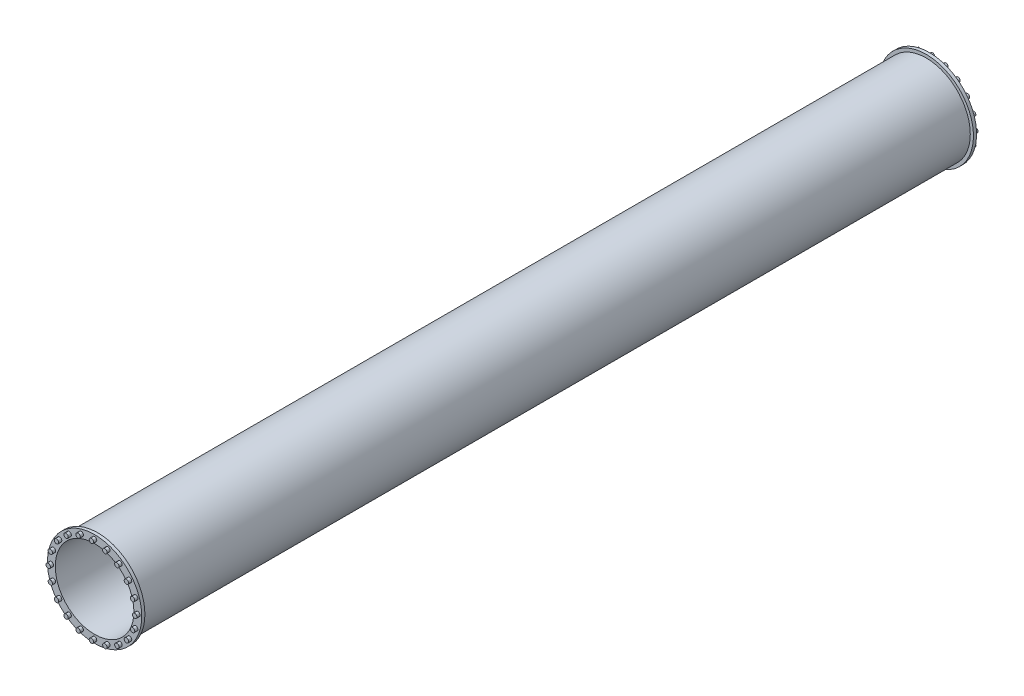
ISO-10303-21;
HEADER;
FILE_DESCRIPTION(('STEP AP214'),'2;1');
FILE_NAME('part.step','',(''),(''),'','','');
FILE_SCHEMA(('AUTOMOTIVE_DESIGN { 1 0 10303 214 1 1 1 1 }'));
ENDSEC;
DATA;
#1=APPLICATION_CONTEXT('core data for automotive mechanical design processes');
#2=APPLICATION_PROTOCOL_DEFINITION('international standard','automotive_design',2000,#1);
#3=PRODUCT_CONTEXT('',#1,'mechanical');
#4=PRODUCT('Part','Part','',(#3));
#5=PRODUCT_RELATED_PRODUCT_CATEGORY('part','',(#4));
#6=PRODUCT_DEFINITION_FORMATION('','',#4);
#7=PRODUCT_DEFINITION_CONTEXT('part definition',#1,'design');
#8=PRODUCT_DEFINITION('design','',#6,#7);
#9=PRODUCT_DEFINITION_SHAPE('','',#8);
#10=(LENGTH_UNIT() NAMED_UNIT(*) SI_UNIT(.MILLI.,.METRE.));
#11=(NAMED_UNIT(*) PLANE_ANGLE_UNIT() SI_UNIT($,.RADIAN.));
#12=(NAMED_UNIT(*) SI_UNIT($,.STERADIAN.) SOLID_ANGLE_UNIT());
#13=UNCERTAINTY_MEASURE_WITH_UNIT(LENGTH_MEASURE(1.E-05),#10,'distance_accuracy_value','');
#14=(GEOMETRIC_REPRESENTATION_CONTEXT(3) GLOBAL_UNCERTAINTY_ASSIGNED_CONTEXT((#13)) GLOBAL_UNIT_ASSIGNED_CONTEXT((#10,
#11,#12)) REPRESENTATION_CONTEXT('',''));
#15=CARTESIAN_POINT('',(0.,0.,0.));
#16=DIRECTION('',(0.,0.,1.));
#17=DIRECTION('',(1.,0.,0.));
#18=AXIS2_PLACEMENT_3D('',#15,#16,#17);
#19=CARTESIAN_POINT('',(0.,0.,10.));
#20=DIRECTION('',(0.,0.,1.));
#21=DIRECTION('',(1.,0.,0.));
#22=AXIS2_PLACEMENT_3D('',#19,#20,#21);
#23=PLANE('',#22);
#24=CARTESIAN_POINT('',(42.4898367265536,130.770270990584,10.));
#25=DIRECTION('',(0.,0.,1.));
#26=DIRECTION('',(0.951056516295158,-0.309016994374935,0.));
#27=AXIS2_PLACEMENT_3D('',#24,#25,#26);
#28=CIRCLE('',#27,7.);
#29=CARTESIAN_POINT('',(49.1472323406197,128.60715202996,10.));
#30=VERTEX_POINT('',#29);
#31=EDGE_CURVE('E65',#30,#30,#28,.T.);
#32=ORIENTED_EDGE('',*,*,#31,.F.);
#33=EDGE_LOOP('',(#32));
#34=FACE_BOUND('',#33,.T.);
#35=CARTESIAN_POINT('',(80.8204721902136,111.239836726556,10.));
#36=DIRECTION('',(0.,0.,1.));
#37=DIRECTION('',(0.809016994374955,-0.587785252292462,0.));
#38=AXIS2_PLACEMENT_3D('',#35,#36,#37);
#39=CIRCLE('',#38,7.);
#40=CARTESIAN_POINT('',(86.4835911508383,107.125339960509,10.));
#41=VERTEX_POINT('',#40);
#42=EDGE_CURVE('E64',#41,#41,#39,.T.);
#43=ORIENTED_EDGE('',*,*,#42,.F.);
#44=EDGE_LOOP('',(#43));
#45=FACE_BOUND('',#44,.T.);
#46=CARTESIAN_POINT('',(111.239836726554,80.8204721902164,10.));
#47=DIRECTION('',(0.,0.,1.));
#48=DIRECTION('',(0.587785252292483,-0.80901699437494,0.));
#49=AXIS2_PLACEMENT_3D('',#46,#47,#48);
#50=CIRCLE('',#49,7.);
#51=CARTESIAN_POINT('',(115.354333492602,75.1573532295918,10.));
#52=VERTEX_POINT('',#51);
#53=EDGE_CURVE('E73',#52,#52,#50,.T.);
#54=ORIENTED_EDGE('',*,*,#53,.F.);
#55=EDGE_LOOP('',(#54));
#56=FACE_BOUND('',#55,.T.);
#57=CARTESIAN_POINT('',(130.770270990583,42.4898367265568,10.));
#58=DIRECTION('',(0.,0.,1.));
#59=DIRECTION('',(0.309016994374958,-0.95105651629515,0.));
#60=AXIS2_PLACEMENT_3D('',#57,#58,#59);
#61=CIRCLE('',#60,7.);
#62=CARTESIAN_POINT('',(132.933389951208,35.8324411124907,10.));
#63=VERTEX_POINT('',#62);
#64=EDGE_CURVE('E81',#63,#63,#61,.T.);
#65=ORIENTED_EDGE('',*,*,#64,.F.);
#66=EDGE_LOOP('',(#65));
#67=FACE_BOUND('',#66,.T.);
#68=CARTESIAN_POINT('',(137.5,1.44023605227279E-12,10.));
#69=DIRECTION('',(0.,0.,1.));
#70=DIRECTION('',(0.,-1.,0.));
#71=AXIS2_PLACEMENT_3D('',#68,#69,#70);
#72=CIRCLE('',#71,7.);
#73=CARTESIAN_POINT('',(137.5,-6.99999999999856,10.));
#74=VERTEX_POINT('',#73);
#75=EDGE_CURVE('E89',#74,#74,#72,.T.);
#76=ORIENTED_EDGE('',*,*,#75,.F.);
#77=EDGE_LOOP('',(#76));
#78=FACE_BOUND('',#77,.T.);
#79=CARTESIAN_POINT('',(130.770270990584,-42.489836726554,10.));
#80=DIRECTION('',(0.,0.,1.));
#81=DIRECTION('',(-0.309016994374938,-0.951056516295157,0.));
#82=AXIS2_PLACEMENT_3D('',#79,#80,#81);
#83=CIRCLE('',#82,7.);
#84=CARTESIAN_POINT('',(128.607152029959,-49.1472323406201,10.));
#85=VERTEX_POINT('',#84);
#86=EDGE_CURVE('E97',#85,#85,#83,.T.);
#87=ORIENTED_EDGE('',*,*,#86,.F.);
#88=EDGE_LOOP('',(#87));
#89=FACE_BOUND('',#88,.T.);
#90=CARTESIAN_POINT('',(111.239836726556,-80.820472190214,10.));
#91=DIRECTION('',(0.,0.,1.));
#92=DIRECTION('',(-0.587785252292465,-0.809016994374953,0.));
#93=AXIS2_PLACEMENT_3D('',#90,#91,#92);
#94=CIRCLE('',#93,7.);
#95=CARTESIAN_POINT('',(107.125339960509,-86.4835911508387,10.));
#96=VERTEX_POINT('',#95);
#97=EDGE_CURVE('E105',#96,#96,#94,.T.);
#98=ORIENTED_EDGE('',*,*,#97,.F.);
#99=EDGE_LOOP('',(#98));
#100=FACE_BOUND('',#99,.T.);
#101=CARTESIAN_POINT('',(80.820472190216,-111.239836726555,10.));
#102=DIRECTION('',(0.,0.,1.));
#103=DIRECTION('',(-0.809016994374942,-0.58778525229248,0.));
#104=AXIS2_PLACEMENT_3D('',#101,#102,#103);
#105=CIRCLE('',#104,7.);
#106=CARTESIAN_POINT('',(75.1573532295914,-115.354333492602,10.));
#107=VERTEX_POINT('',#106);
#108=EDGE_CURVE('E113',#107,#107,#105,.T.);
#109=ORIENTED_EDGE('',*,*,#108,.F.);
#110=EDGE_LOOP('',(#109));
#111=FACE_BOUND('',#110,.T.);
#112=CARTESIAN_POINT('',(42.4898367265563,-130.770270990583,10.));
#113=DIRECTION('',(0.,0.,1.));
#114=DIRECTION('',(-0.951056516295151,-0.309016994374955,0.));
#115=AXIS2_PLACEMENT_3D('',#112,#113,#114);
#116=CIRCLE('',#115,7.);
#117=CARTESIAN_POINT('',(35.8324411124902,-132.933389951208,10.));
#118=VERTEX_POINT('',#117);
#119=EDGE_CURVE('E121',#118,#118,#116,.T.);
#120=ORIENTED_EDGE('',*,*,#119,.F.);
#121=EDGE_LOOP('',(#120));
#122=FACE_BOUND('',#121,.T.);
#123=CARTESIAN_POINT('',(0.,-137.5,10.));
#124=DIRECTION('',(0.,0.,1.));
#125=DIRECTION('',(-1.,0.,0.));
#126=AXIS2_PLACEMENT_3D('',#123,#124,#125);
#127=CIRCLE('',#126,7.);
#128=CARTESIAN_POINT('',(-7.,-137.5,10.));
#129=VERTEX_POINT('',#128);
#130=EDGE_CURVE('E129',#129,#129,#127,.T.);
#131=ORIENTED_EDGE('',*,*,#130,.F.);
#132=EDGE_LOOP('',(#131));
#133=FACE_BOUND('',#132,.T.);
#134=CARTESIAN_POINT('',(-42.4898367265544,-130.770270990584,10.));
#135=DIRECTION('',(0.,0.,1.));
#136=DIRECTION('',(-0.951056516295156,0.309016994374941,0.));
#137=AXIS2_PLACEMENT_3D('',#134,#135,#136);
#138=CIRCLE('',#137,7.);
#139=CARTESIAN_POINT('',(-49.1472323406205,-128.607152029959,10.));
#140=VERTEX_POINT('',#139);
#141=EDGE_CURVE('E137',#140,#140,#138,.T.);
#142=ORIENTED_EDGE('',*,*,#141,.F.);
#143=EDGE_LOOP('',(#142));
#144=FACE_BOUND('',#143,.T.);
#145=CARTESIAN_POINT('',(-80.8204721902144,-111.239836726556,10.));
#146=DIRECTION('',(0.,0.,1.));
#147=DIRECTION('',(-0.809016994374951,0.587785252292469,0.));
#148=AXIS2_PLACEMENT_3D('',#145,#146,#147);
#149=CIRCLE('',#148,7.);
#150=CARTESIAN_POINT('',(-86.4835911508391,-107.125339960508,10.));
#151=VERTEX_POINT('',#150);
#152=EDGE_CURVE('E145',#151,#151,#149,.T.);
#153=ORIENTED_EDGE('',*,*,#152,.F.);
#154=EDGE_LOOP('',(#153));
#155=FACE_BOUND('',#154,.T.);
#156=CARTESIAN_POINT('',(-111.239836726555,-80.8204721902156,10.));
#157=DIRECTION('',(0.,0.,1.));
#158=DIRECTION('',(-0.587785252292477,0.809016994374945,0.));
#159=AXIS2_PLACEMENT_3D('',#156,#157,#158);
#160=CIRCLE('',#159,7.);
#161=CARTESIAN_POINT('',(-115.354333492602,-75.157353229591,10.));
#162=VERTEX_POINT('',#161);
#163=EDGE_CURVE('E153',#162,#162,#160,.T.);
#164=ORIENTED_EDGE('',*,*,#163,.F.);
#165=EDGE_LOOP('',(#164));
#166=FACE_BOUND('',#165,.T.);
#167=CARTESIAN_POINT('',(-130.770270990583,-42.4898367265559,10.));
#168=DIRECTION('',(0.,0.,1.));
#169=DIRECTION('',(-0.309016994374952,0.951056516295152,0.));
#170=AXIS2_PLACEMENT_3D('',#167,#168,#169);
#171=CIRCLE('',#170,7.);
#172=CARTESIAN_POINT('',(-132.933389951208,-35.8324411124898,10.));
#173=VERTEX_POINT('',#172);
#174=EDGE_CURVE('E161',#173,#173,#171,.T.);
#175=ORIENTED_EDGE('',*,*,#174,.F.);
#176=EDGE_LOOP('',(#175));
#177=FACE_BOUND('',#176,.T.);
#178=CARTESIAN_POINT('',(-137.5,-4.80078684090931E-13,10.));
#179=DIRECTION('',(0.,0.,1.));
#180=DIRECTION('',(0.,1.,0.));
#181=AXIS2_PLACEMENT_3D('',#178,#179,#180);
#182=CIRCLE('',#181,7.);
#183=CARTESIAN_POINT('',(-137.5,6.99999999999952,10.));
#184=VERTEX_POINT('',#183);
#185=EDGE_CURVE('E169',#184,#184,#182,.T.);
#186=ORIENTED_EDGE('',*,*,#185,.F.);
#187=EDGE_LOOP('',(#186));
#188=FACE_BOUND('',#187,.T.);
#189=CARTESIAN_POINT('',(-130.770270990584,42.4898367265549,10.));
#190=DIRECTION('',(0.,0.,1.));
#191=DIRECTION('',(0.309016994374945,0.951056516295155,0.));
#192=AXIS2_PLACEMENT_3D('',#189,#190,#191);
#193=CIRCLE('',#192,7.);
#194=CARTESIAN_POINT('',(-128.607152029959,49.147232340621,10.));
#195=VERTEX_POINT('',#194);
#196=EDGE_CURVE('E177',#195,#195,#193,.T.);
#197=ORIENTED_EDGE('',*,*,#196,.F.);
#198=EDGE_LOOP('',(#197));
#199=FACE_BOUND('',#198,.T.);
#200=CARTESIAN_POINT('',(-111.239836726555,80.8204721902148,10.));
#201=DIRECTION('',(0.,0.,1.));
#202=DIRECTION('',(0.587785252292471,0.809016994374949,0.));
#203=AXIS2_PLACEMENT_3D('',#200,#201,#202);
#204=CIRCLE('',#203,7.);
#205=CARTESIAN_POINT('',(-107.125339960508,86.4835911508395,10.));
#206=VERTEX_POINT('',#205);
#207=EDGE_CURVE('E185',#206,#206,#204,.T.);
#208=ORIENTED_EDGE('',*,*,#207,.F.);
#209=EDGE_LOOP('',(#208));
#210=FACE_BOUND('',#209,.T.);
#211=CARTESIAN_POINT('',(-80.8204721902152,111.239836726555,10.));
#212=DIRECTION('',(0.,0.,1.));
#213=DIRECTION('',(0.809016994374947,0.587785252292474,0.));
#214=AXIS2_PLACEMENT_3D('',#211,#212,#213);
#215=CIRCLE('',#214,7.);
#216=CARTESIAN_POINT('',(-75.1573532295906,115.354333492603,10.));
#217=VERTEX_POINT('',#216);
#218=EDGE_CURVE('E193',#217,#217,#215,.T.);
#219=ORIENTED_EDGE('',*,*,#218,.F.);
#220=EDGE_LOOP('',(#219));
#221=FACE_BOUND('',#220,.T.);
#222=CARTESIAN_POINT('',(-42.4898367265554,130.770270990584,10.));
#223=DIRECTION('',(0.,0.,1.));
#224=DIRECTION('',(0.951056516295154,0.309016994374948,0.));
#225=AXIS2_PLACEMENT_3D('',#222,#223,#224);
#226=CIRCLE('',#225,7.);
#227=CARTESIAN_POINT('',(-35.8324411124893,132.933389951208,10.));
#228=VERTEX_POINT('',#227);
#229=EDGE_CURVE('E201',#228,#228,#226,.T.);
#230=ORIENTED_EDGE('',*,*,#229,.F.);
#231=EDGE_LOOP('',(#230));
#232=FACE_BOUND('',#231,.T.);
#233=CARTESIAN_POINT('',(0.,137.5,10.));
#234=DIRECTION('',(0.,0.,1.));
#235=DIRECTION('',(1.,0.,0.));
#236=AXIS2_PLACEMENT_3D('',#233,#234,#235);
#237=CIRCLE('',#236,7.);
#238=CARTESIAN_POINT('',(7.,137.5,10.));
#239=VERTEX_POINT('',#238);
#240=EDGE_CURVE('E209',#239,#239,#237,.T.);
#241=ORIENTED_EDGE('',*,*,#240,.F.);
#242=EDGE_LOOP('',(#241));
#243=FACE_BOUND('',#242,.T.);
#244=CARTESIAN_POINT('',(0.,0.,10.));
#245=DIRECTION('',(0.,0.,1.));
#246=DIRECTION('',(1.,0.,0.));
#247=AXIS2_PLACEMENT_3D('',#244,#245,#246);
#248=CIRCLE('',#247,150.);
#249=CARTESIAN_POINT('',(150.,0.,10.));
#250=VERTEX_POINT('',#249);
#251=EDGE_CURVE('E50',#250,#250,#248,.T.);
#252=ORIENTED_EDGE('',*,*,#251,.T.);
#253=EDGE_LOOP('',(#252));
#254=FACE_BOUND('',#253,.T.);
#255=CARTESIAN_POINT('',(0.,0.,10.));
#256=DIRECTION('',(0.,0.,1.));
#257=DIRECTION('',(1.,0.,0.));
#258=AXIS2_PLACEMENT_3D('',#255,#256,#257);
#259=CIRCLE('',#258,125.);
#260=CARTESIAN_POINT('',(125.,0.,10.));
#261=VERTEX_POINT('',#260);
#262=EDGE_CURVE('E217',#261,#261,#259,.T.);
#263=ORIENTED_EDGE('',*,*,#262,.F.);
#264=EDGE_LOOP('',(#263));
#265=FACE_BOUND('',#264,.T.);
#266=ADVANCED_FACE('F41',(#34,#45,#56,#67,#78,#89,#100,#111,#122,#133,#144,#155,#166,#177,#188,
#199,#210,#221,#232,#243,#254,#265),#23,.T.);
#267=CARTESIAN_POINT('',(0.,0.,0.));
#268=DIRECTION('',(0.,0.,1.));
#269=DIRECTION('',(1.,0.,0.));
#270=AXIS2_PLACEMENT_3D('',#267,#268,#269);
#271=PLANE('',#270);
#272=CARTESIAN_POINT('',(0.,0.,0.));
#273=DIRECTION('',(0.,0.,-1.));
#274=DIRECTION('',(-1.,0.,0.));
#275=AXIS2_PLACEMENT_3D('',#272,#273,#274);
#276=CIRCLE('',#275,140.);
#277=CARTESIAN_POINT('',(140.,0.,4.44089209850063E-13));
#278=VERTEX_POINT('',#277);
#279=EDGE_CURVE('E10',#278,#278,#276,.T.);
#280=ORIENTED_EDGE('',*,*,#279,.F.);
#281=EDGE_LOOP('',(#280));
#282=FACE_BOUND('',#281,.T.);
#283=CARTESIAN_POINT('',(0.,0.,0.));
#284=DIRECTION('',(0.,0.,1.));
#285=DIRECTION('',(1.,0.,0.));
#286=AXIS2_PLACEMENT_3D('',#283,#284,#285);
#287=CIRCLE('',#286,150.);
#288=CARTESIAN_POINT('',(150.,0.,0.));
#289=VERTEX_POINT('',#288);
#290=EDGE_CURVE('E45',#289,#289,#287,.T.);
#291=ORIENTED_EDGE('',*,*,#290,.F.);
#292=EDGE_LOOP('',(#291));
#293=FACE_BOUND('',#292,.T.);
#294=ADVANCED_FACE('F230',(#282,#293),#271,.F.);
#295=CARTESIAN_POINT('',(0.,0.,10.));
#296=DIRECTION('',(0.,0.,-1.));
#297=DIRECTION('',(-1.,0.,0.));
#298=AXIS2_PLACEMENT_3D('',#295,#296,#297);
#299=CYLINDRICAL_SURFACE('',#298,150.);
#300=ORIENTED_EDGE('',*,*,#251,.F.);
#301=EDGE_LOOP('',(#300));
#302=FACE_BOUND('',#301,.T.);
#303=ORIENTED_EDGE('',*,*,#290,.T.);
#304=EDGE_LOOP('',(#303));
#305=FACE_BOUND('',#304,.T.);
#306=ADVANCED_FACE('F43',(#302,#305),#299,.T.);
#307=CARTESIAN_POINT('',(0.,0.,10.));
#308=DIRECTION('',(0.,0.,-1.));
#309=DIRECTION('',(-1.,0.,0.));
#310=AXIS2_PLACEMENT_3D('',#307,#308,#309);
#311=CYLINDRICAL_SURFACE('',#310,125.);
#312=ORIENTED_EDGE('',*,*,#262,.T.);
#313=EDGE_LOOP('',(#312));
#314=FACE_BOUND('',#313,.T.);
#315=CARTESIAN_POINT('',(0.,0.,-2645.));
#316=DIRECTION('',(0.,0.,-1.));
#317=DIRECTION('',(-1.,0.,0.));
#318=AXIS2_PLACEMENT_3D('',#315,#316,#317);
#319=CIRCLE('',#318,125.);
#320=CARTESIAN_POINT('',(-125.,0.,-2645.));
#321=VERTEX_POINT('',#320);
#322=EDGE_CURVE('E740',#321,#321,#319,.T.);
#323=ORIENTED_EDGE('',*,*,#322,.T.);
#324=EDGE_LOOP('',(#323));
#325=FACE_BOUND('',#324,.T.);
#326=ADVANCED_FACE('F237',(#314,#325),#311,.F.);
#327=CARTESIAN_POINT('',(0.,137.5,20.));
#328=DIRECTION('',(0.,0.,-1.));
#329=DIRECTION('',(-1.,0.,0.));
#330=AXIS2_PLACEMENT_3D('',#327,#328,#329);
#331=CYLINDRICAL_SURFACE('',#330,7.);
#332=CARTESIAN_POINT('',(0.,137.5,20.));
#333=DIRECTION('',(0.,0.,1.));
#334=DIRECTION('',(1.,0.,0.));
#335=AXIS2_PLACEMENT_3D('',#332,#333,#334);
#336=CIRCLE('',#335,7.);
#337=CARTESIAN_POINT('',(7.,137.5,20.));
#338=VERTEX_POINT('',#337);
#339=EDGE_CURVE('E213',#338,#338,#336,.T.);
#340=ORIENTED_EDGE('',*,*,#339,.F.);
#341=EDGE_LOOP('',(#340));
#342=FACE_BOUND('',#341,.T.);
#343=ORIENTED_EDGE('',*,*,#240,.T.);
#344=EDGE_LOOP('',(#343));
#345=FACE_BOUND('',#344,.T.);
#346=ADVANCED_FACE('F244',(#342,#345),#331,.T.);
#347=CARTESIAN_POINT('',(0.,137.5,20.));
#348=DIRECTION('',(0.,0.,1.));
#349=DIRECTION('',(1.,0.,0.));
#350=AXIS2_PLACEMENT_3D('',#347,#348,#349);
#351=PLANE('',#350);
#352=ORIENTED_EDGE('',*,*,#339,.T.);
#353=EDGE_LOOP('',(#352));
#354=FACE_BOUND('',#353,.T.);
#355=ADVANCED_FACE('F247',(#354),#351,.T.);
#356=CARTESIAN_POINT('',(-42.4898367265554,130.770270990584,20.));
#357=DIRECTION('',(0.,0.,-1.));
#358=DIRECTION('',(-1.,0.,0.));
#359=AXIS2_PLACEMENT_3D('',#356,#357,#358);
#360=CYLINDRICAL_SURFACE('',#359,7.);
#361=CARTESIAN_POINT('',(-42.4898367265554,130.770270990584,20.));
#362=DIRECTION('',(0.,0.,1.));
#363=DIRECTION('',(0.951056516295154,0.309016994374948,0.));
#364=AXIS2_PLACEMENT_3D('',#361,#362,#363);
#365=CIRCLE('',#364,7.);
#366=CARTESIAN_POINT('',(-35.8324411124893,132.933389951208,20.));
#367=VERTEX_POINT('',#366);
#368=EDGE_CURVE('E205',#367,#367,#365,.T.);
#369=ORIENTED_EDGE('',*,*,#368,.F.);
#370=EDGE_LOOP('',(#369));
#371=FACE_BOUND('',#370,.T.);
#372=ORIENTED_EDGE('',*,*,#229,.T.);
#373=EDGE_LOOP('',(#372));
#374=FACE_BOUND('',#373,.T.);
#375=ADVANCED_FACE('F251',(#371,#374),#360,.T.);
#376=CARTESIAN_POINT('',(-42.4898367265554,130.770270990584,20.));
#377=DIRECTION('',(0.,0.,1.));
#378=DIRECTION('',(0.951056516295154,0.309016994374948,0.));
#379=AXIS2_PLACEMENT_3D('',#376,#377,#378);
#380=PLANE('',#379);
#381=ORIENTED_EDGE('',*,*,#368,.T.);
#382=EDGE_LOOP('',(#381));
#383=FACE_BOUND('',#382,.T.);
#384=ADVANCED_FACE('F255',(#383),#380,.T.);
#385=CARTESIAN_POINT('',(-80.8204721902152,111.239836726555,20.));
#386=DIRECTION('',(0.,0.,-1.));
#387=DIRECTION('',(-1.,0.,0.));
#388=AXIS2_PLACEMENT_3D('',#385,#386,#387);
#389=CYLINDRICAL_SURFACE('',#388,7.);
#390=CARTESIAN_POINT('',(-80.8204721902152,111.239836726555,20.));
#391=DIRECTION('',(0.,0.,1.));
#392=DIRECTION('',(0.809016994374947,0.587785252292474,0.));
#393=AXIS2_PLACEMENT_3D('',#390,#391,#392);
#394=CIRCLE('',#393,7.);
#395=CARTESIAN_POINT('',(-75.1573532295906,115.354333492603,20.));
#396=VERTEX_POINT('',#395);
#397=EDGE_CURVE('E197',#396,#396,#394,.T.);
#398=ORIENTED_EDGE('',*,*,#397,.F.);
#399=EDGE_LOOP('',(#398));
#400=FACE_BOUND('',#399,.T.);
#401=ORIENTED_EDGE('',*,*,#218,.T.);
#402=EDGE_LOOP('',(#401));
#403=FACE_BOUND('',#402,.T.);
#404=ADVANCED_FACE('F259',(#400,#403),#389,.T.);
#405=CARTESIAN_POINT('',(-80.8204721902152,111.239836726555,20.));
#406=DIRECTION('',(0.,0.,1.));
#407=DIRECTION('',(0.809016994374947,0.587785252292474,0.));
#408=AXIS2_PLACEMENT_3D('',#405,#406,#407);
#409=PLANE('',#408);
#410=ORIENTED_EDGE('',*,*,#397,.T.);
#411=EDGE_LOOP('',(#410));
#412=FACE_BOUND('',#411,.T.);
#413=ADVANCED_FACE('F263',(#412),#409,.T.);
#414=CARTESIAN_POINT('',(-111.239836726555,80.8204721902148,20.));
#415=DIRECTION('',(0.,0.,-1.));
#416=DIRECTION('',(-1.,0.,0.));
#417=AXIS2_PLACEMENT_3D('',#414,#415,#416);
#418=CYLINDRICAL_SURFACE('',#417,7.);
#419=CARTESIAN_POINT('',(-111.239836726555,80.8204721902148,20.));
#420=DIRECTION('',(0.,0.,1.));
#421=DIRECTION('',(0.587785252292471,0.809016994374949,0.));
#422=AXIS2_PLACEMENT_3D('',#419,#420,#421);
#423=CIRCLE('',#422,7.);
#424=CARTESIAN_POINT('',(-107.125339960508,86.4835911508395,20.));
#425=VERTEX_POINT('',#424);
#426=EDGE_CURVE('E189',#425,#425,#423,.T.);
#427=ORIENTED_EDGE('',*,*,#426,.F.);
#428=EDGE_LOOP('',(#427));
#429=FACE_BOUND('',#428,.T.);
#430=ORIENTED_EDGE('',*,*,#207,.T.);
#431=EDGE_LOOP('',(#430));
#432=FACE_BOUND('',#431,.T.);
#433=ADVANCED_FACE('F267',(#429,#432),#418,.T.);
#434=CARTESIAN_POINT('',(-111.239836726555,80.8204721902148,20.));
#435=DIRECTION('',(0.,0.,1.));
#436=DIRECTION('',(0.587785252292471,0.809016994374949,0.));
#437=AXIS2_PLACEMENT_3D('',#434,#435,#436);
#438=PLANE('',#437);
#439=ORIENTED_EDGE('',*,*,#426,.T.);
#440=EDGE_LOOP('',(#439));
#441=FACE_BOUND('',#440,.T.);
#442=ADVANCED_FACE('F271',(#441),#438,.T.);
#443=CARTESIAN_POINT('',(-130.770270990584,42.4898367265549,20.));
#444=DIRECTION('',(0.,0.,-1.));
#445=DIRECTION('',(-1.,0.,0.));
#446=AXIS2_PLACEMENT_3D('',#443,#444,#445);
#447=CYLINDRICAL_SURFACE('',#446,7.);
#448=CARTESIAN_POINT('',(-130.770270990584,42.4898367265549,20.));
#449=DIRECTION('',(0.,0.,1.));
#450=DIRECTION('',(0.309016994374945,0.951056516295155,0.));
#451=AXIS2_PLACEMENT_3D('',#448,#449,#450);
#452=CIRCLE('',#451,7.);
#453=CARTESIAN_POINT('',(-128.607152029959,49.147232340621,20.));
#454=VERTEX_POINT('',#453);
#455=EDGE_CURVE('E181',#454,#454,#452,.T.);
#456=ORIENTED_EDGE('',*,*,#455,.F.);
#457=EDGE_LOOP('',(#456));
#458=FACE_BOUND('',#457,.T.);
#459=ORIENTED_EDGE('',*,*,#196,.T.);
#460=EDGE_LOOP('',(#459));
#461=FACE_BOUND('',#460,.T.);
#462=ADVANCED_FACE('F275',(#458,#461),#447,.T.);
#463=CARTESIAN_POINT('',(-130.770270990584,42.4898367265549,20.));
#464=DIRECTION('',(0.,0.,1.));
#465=DIRECTION('',(0.309016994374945,0.951056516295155,0.));
#466=AXIS2_PLACEMENT_3D('',#463,#464,#465);
#467=PLANE('',#466);
#468=ORIENTED_EDGE('',*,*,#455,.T.);
#469=EDGE_LOOP('',(#468));
#470=FACE_BOUND('',#469,.T.);
#471=ADVANCED_FACE('F279',(#470),#467,.T.);
#472=CARTESIAN_POINT('',(-137.5,-4.80078684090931E-13,20.));
#473=DIRECTION('',(0.,0.,-1.));
#474=DIRECTION('',(-1.,0.,0.));
#475=AXIS2_PLACEMENT_3D('',#472,#473,#474);
#476=CYLINDRICAL_SURFACE('',#475,7.);
#477=CARTESIAN_POINT('',(-137.5,-4.80078684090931E-13,20.));
#478=DIRECTION('',(0.,0.,1.));
#479=DIRECTION('',(0.,1.,0.));
#480=AXIS2_PLACEMENT_3D('',#477,#478,#479);
#481=CIRCLE('',#480,7.);
#482=CARTESIAN_POINT('',(-137.5,6.99999999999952,20.));
#483=VERTEX_POINT('',#482);
#484=EDGE_CURVE('E173',#483,#483,#481,.T.);
#485=ORIENTED_EDGE('',*,*,#484,.F.);
#486=EDGE_LOOP('',(#485));
#487=FACE_BOUND('',#486,.T.);
#488=ORIENTED_EDGE('',*,*,#185,.T.);
#489=EDGE_LOOP('',(#488));
#490=FACE_BOUND('',#489,.T.);
#491=ADVANCED_FACE('F283',(#487,#490),#476,.T.);
#492=CARTESIAN_POINT('',(-137.5,-4.80078684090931E-13,20.));
#493=DIRECTION('',(0.,0.,1.));
#494=DIRECTION('',(0.,1.,0.));
#495=AXIS2_PLACEMENT_3D('',#492,#493,#494);
#496=PLANE('',#495);
#497=ORIENTED_EDGE('',*,*,#484,.T.);
#498=EDGE_LOOP('',(#497));
#499=FACE_BOUND('',#498,.T.);
#500=ADVANCED_FACE('F287',(#499),#496,.T.);
#501=CARTESIAN_POINT('',(-130.770270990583,-42.4898367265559,20.));
#502=DIRECTION('',(0.,0.,-1.));
#503=DIRECTION('',(-1.,0.,0.));
#504=AXIS2_PLACEMENT_3D('',#501,#502,#503);
#505=CYLINDRICAL_SURFACE('',#504,7.);
#506=CARTESIAN_POINT('',(-130.770270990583,-42.4898367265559,20.));
#507=DIRECTION('',(0.,0.,1.));
#508=DIRECTION('',(-0.309016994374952,0.951056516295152,0.));
#509=AXIS2_PLACEMENT_3D('',#506,#507,#508);
#510=CIRCLE('',#509,7.);
#511=CARTESIAN_POINT('',(-132.933389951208,-35.8324411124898,20.));
#512=VERTEX_POINT('',#511);
#513=EDGE_CURVE('E165',#512,#512,#510,.T.);
#514=ORIENTED_EDGE('',*,*,#513,.F.);
#515=EDGE_LOOP('',(#514));
#516=FACE_BOUND('',#515,.T.);
#517=ORIENTED_EDGE('',*,*,#174,.T.);
#518=EDGE_LOOP('',(#517));
#519=FACE_BOUND('',#518,.T.);
#520=ADVANCED_FACE('F291',(#516,#519),#505,.T.);
#521=CARTESIAN_POINT('',(-130.770270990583,-42.4898367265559,20.));
#522=DIRECTION('',(0.,0.,1.));
#523=DIRECTION('',(-0.309016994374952,0.951056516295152,0.));
#524=AXIS2_PLACEMENT_3D('',#521,#522,#523);
#525=PLANE('',#524);
#526=ORIENTED_EDGE('',*,*,#513,.T.);
#527=EDGE_LOOP('',(#526));
#528=FACE_BOUND('',#527,.T.);
#529=ADVANCED_FACE('F295',(#528),#525,.T.);
#530=CARTESIAN_POINT('',(-111.239836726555,-80.8204721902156,20.));
#531=DIRECTION('',(0.,0.,-1.));
#532=DIRECTION('',(-1.,0.,0.));
#533=AXIS2_PLACEMENT_3D('',#530,#531,#532);
#534=CYLINDRICAL_SURFACE('',#533,7.);
#535=CARTESIAN_POINT('',(-111.239836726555,-80.8204721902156,20.));
#536=DIRECTION('',(0.,0.,1.));
#537=DIRECTION('',(-0.587785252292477,0.809016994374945,0.));
#538=AXIS2_PLACEMENT_3D('',#535,#536,#537);
#539=CIRCLE('',#538,7.);
#540=CARTESIAN_POINT('',(-115.354333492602,-75.157353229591,20.));
#541=VERTEX_POINT('',#540);
#542=EDGE_CURVE('E157',#541,#541,#539,.T.);
#543=ORIENTED_EDGE('',*,*,#542,.F.);
#544=EDGE_LOOP('',(#543));
#545=FACE_BOUND('',#544,.T.);
#546=ORIENTED_EDGE('',*,*,#163,.T.);
#547=EDGE_LOOP('',(#546));
#548=FACE_BOUND('',#547,.T.);
#549=ADVANCED_FACE('F299',(#545,#548),#534,.T.);
#550=CARTESIAN_POINT('',(-111.239836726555,-80.8204721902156,20.));
#551=DIRECTION('',(0.,0.,1.));
#552=DIRECTION('',(-0.587785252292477,0.809016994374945,0.));
#553=AXIS2_PLACEMENT_3D('',#550,#551,#552);
#554=PLANE('',#553);
#555=ORIENTED_EDGE('',*,*,#542,.T.);
#556=EDGE_LOOP('',(#555));
#557=FACE_BOUND('',#556,.T.);
#558=ADVANCED_FACE('F303',(#557),#554,.T.);
#559=CARTESIAN_POINT('',(-80.8204721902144,-111.239836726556,20.));
#560=DIRECTION('',(0.,0.,-1.));
#561=DIRECTION('',(-1.,0.,0.));
#562=AXIS2_PLACEMENT_3D('',#559,#560,#561);
#563=CYLINDRICAL_SURFACE('',#562,7.);
#564=CARTESIAN_POINT('',(-80.8204721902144,-111.239836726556,20.));
#565=DIRECTION('',(0.,0.,1.));
#566=DIRECTION('',(-0.809016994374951,0.587785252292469,0.));
#567=AXIS2_PLACEMENT_3D('',#564,#565,#566);
#568=CIRCLE('',#567,7.);
#569=CARTESIAN_POINT('',(-86.4835911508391,-107.125339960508,20.));
#570=VERTEX_POINT('',#569);
#571=EDGE_CURVE('E149',#570,#570,#568,.T.);
#572=ORIENTED_EDGE('',*,*,#571,.F.);
#573=EDGE_LOOP('',(#572));
#574=FACE_BOUND('',#573,.T.);
#575=ORIENTED_EDGE('',*,*,#152,.T.);
#576=EDGE_LOOP('',(#575));
#577=FACE_BOUND('',#576,.T.);
#578=ADVANCED_FACE('F307',(#574,#577),#563,.T.);
#579=CARTESIAN_POINT('',(-80.8204721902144,-111.239836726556,20.));
#580=DIRECTION('',(0.,0.,1.));
#581=DIRECTION('',(-0.809016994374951,0.587785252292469,0.));
#582=AXIS2_PLACEMENT_3D('',#579,#580,#581);
#583=PLANE('',#582);
#584=ORIENTED_EDGE('',*,*,#571,.T.);
#585=EDGE_LOOP('',(#584));
#586=FACE_BOUND('',#585,.T.);
#587=ADVANCED_FACE('F311',(#586),#583,.T.);
#588=CARTESIAN_POINT('',(-42.4898367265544,-130.770270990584,20.));
#589=DIRECTION('',(0.,0.,-1.));
#590=DIRECTION('',(-1.,0.,0.));
#591=AXIS2_PLACEMENT_3D('',#588,#589,#590);
#592=CYLINDRICAL_SURFACE('',#591,7.);
#593=CARTESIAN_POINT('',(-42.4898367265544,-130.770270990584,20.));
#594=DIRECTION('',(0.,0.,1.));
#595=DIRECTION('',(-0.951056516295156,0.309016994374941,0.));
#596=AXIS2_PLACEMENT_3D('',#593,#594,#595);
#597=CIRCLE('',#596,7.);
#598=CARTESIAN_POINT('',(-49.1472323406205,-128.607152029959,20.));
#599=VERTEX_POINT('',#598);
#600=EDGE_CURVE('E141',#599,#599,#597,.T.);
#601=ORIENTED_EDGE('',*,*,#600,.F.);
#602=EDGE_LOOP('',(#601));
#603=FACE_BOUND('',#602,.T.);
#604=ORIENTED_EDGE('',*,*,#141,.T.);
#605=EDGE_LOOP('',(#604));
#606=FACE_BOUND('',#605,.T.);
#607=ADVANCED_FACE('F315',(#603,#606),#592,.T.);
#608=CARTESIAN_POINT('',(-42.4898367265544,-130.770270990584,20.));
#609=DIRECTION('',(0.,0.,1.));
#610=DIRECTION('',(-0.951056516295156,0.309016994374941,0.));
#611=AXIS2_PLACEMENT_3D('',#608,#609,#610);
#612=PLANE('',#611);
#613=ORIENTED_EDGE('',*,*,#600,.T.);
#614=EDGE_LOOP('',(#613));
#615=FACE_BOUND('',#614,.T.);
#616=ADVANCED_FACE('F319',(#615),#612,.T.);
#617=CARTESIAN_POINT('',(0.,-137.5,20.));
#618=DIRECTION('',(0.,0.,-1.));
#619=DIRECTION('',(-1.,0.,0.));
#620=AXIS2_PLACEMENT_3D('',#617,#618,#619);
#621=CYLINDRICAL_SURFACE('',#620,7.);
#622=CARTESIAN_POINT('',(0.,-137.5,20.));
#623=DIRECTION('',(0.,0.,1.));
#624=DIRECTION('',(-1.,0.,0.));
#625=AXIS2_PLACEMENT_3D('',#622,#623,#624);
#626=CIRCLE('',#625,7.);
#627=CARTESIAN_POINT('',(-7.,-137.5,20.));
#628=VERTEX_POINT('',#627);
#629=EDGE_CURVE('E133',#628,#628,#626,.T.);
#630=ORIENTED_EDGE('',*,*,#629,.F.);
#631=EDGE_LOOP('',(#630));
#632=FACE_BOUND('',#631,.T.);
#633=ORIENTED_EDGE('',*,*,#130,.T.);
#634=EDGE_LOOP('',(#633));
#635=FACE_BOUND('',#634,.T.);
#636=ADVANCED_FACE('F323',(#632,#635),#621,.T.);
#637=CARTESIAN_POINT('',(0.,-137.5,20.));
#638=DIRECTION('',(0.,0.,1.));
#639=DIRECTION('',(-1.,0.,0.));
#640=AXIS2_PLACEMENT_3D('',#637,#638,#639);
#641=PLANE('',#640);
#642=ORIENTED_EDGE('',*,*,#629,.T.);
#643=EDGE_LOOP('',(#642));
#644=FACE_BOUND('',#643,.T.);
#645=ADVANCED_FACE('F327',(#644),#641,.T.);
#646=CARTESIAN_POINT('',(42.4898367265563,-130.770270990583,20.));
#647=DIRECTION('',(0.,0.,-1.));
#648=DIRECTION('',(-1.,0.,0.));
#649=AXIS2_PLACEMENT_3D('',#646,#647,#648);
#650=CYLINDRICAL_SURFACE('',#649,7.);
#651=CARTESIAN_POINT('',(42.4898367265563,-130.770270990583,20.));
#652=DIRECTION('',(0.,0.,1.));
#653=DIRECTION('',(-0.951056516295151,-0.309016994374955,0.));
#654=AXIS2_PLACEMENT_3D('',#651,#652,#653);
#655=CIRCLE('',#654,7.);
#656=CARTESIAN_POINT('',(35.8324411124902,-132.933389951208,20.));
#657=VERTEX_POINT('',#656);
#658=EDGE_CURVE('E125',#657,#657,#655,.T.);
#659=ORIENTED_EDGE('',*,*,#658,.F.);
#660=EDGE_LOOP('',(#659));
#661=FACE_BOUND('',#660,.T.);
#662=ORIENTED_EDGE('',*,*,#119,.T.);
#663=EDGE_LOOP('',(#662));
#664=FACE_BOUND('',#663,.T.);
#665=ADVANCED_FACE('F331',(#661,#664),#650,.T.);
#666=CARTESIAN_POINT('',(42.4898367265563,-130.770270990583,20.));
#667=DIRECTION('',(0.,0.,1.));
#668=DIRECTION('',(-0.951056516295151,-0.309016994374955,0.));
#669=AXIS2_PLACEMENT_3D('',#666,#667,#668);
#670=PLANE('',#669);
#671=ORIENTED_EDGE('',*,*,#658,.T.);
#672=EDGE_LOOP('',(#671));
#673=FACE_BOUND('',#672,.T.);
#674=ADVANCED_FACE('F335',(#673),#670,.T.);
#675=CARTESIAN_POINT('',(80.820472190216,-111.239836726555,20.));
#676=DIRECTION('',(0.,0.,-1.));
#677=DIRECTION('',(-1.,0.,0.));
#678=AXIS2_PLACEMENT_3D('',#675,#676,#677);
#679=CYLINDRICAL_SURFACE('',#678,7.);
#680=CARTESIAN_POINT('',(80.820472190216,-111.239836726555,20.));
#681=DIRECTION('',(0.,0.,1.));
#682=DIRECTION('',(-0.809016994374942,-0.58778525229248,0.));
#683=AXIS2_PLACEMENT_3D('',#680,#681,#682);
#684=CIRCLE('',#683,7.);
#685=CARTESIAN_POINT('',(75.1573532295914,-115.354333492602,20.));
#686=VERTEX_POINT('',#685);
#687=EDGE_CURVE('E117',#686,#686,#684,.T.);
#688=ORIENTED_EDGE('',*,*,#687,.F.);
#689=EDGE_LOOP('',(#688));
#690=FACE_BOUND('',#689,.T.);
#691=ORIENTED_EDGE('',*,*,#108,.T.);
#692=EDGE_LOOP('',(#691));
#693=FACE_BOUND('',#692,.T.);
#694=ADVANCED_FACE('F339',(#690,#693),#679,.T.);
#695=CARTESIAN_POINT('',(80.820472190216,-111.239836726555,20.));
#696=DIRECTION('',(0.,0.,1.));
#697=DIRECTION('',(-0.809016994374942,-0.58778525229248,0.));
#698=AXIS2_PLACEMENT_3D('',#695,#696,#697);
#699=PLANE('',#698);
#700=ORIENTED_EDGE('',*,*,#687,.T.);
#701=EDGE_LOOP('',(#700));
#702=FACE_BOUND('',#701,.T.);
#703=ADVANCED_FACE('F343',(#702),#699,.T.);
#704=CARTESIAN_POINT('',(111.239836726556,-80.820472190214,20.));
#705=DIRECTION('',(0.,0.,-1.));
#706=DIRECTION('',(-1.,0.,0.));
#707=AXIS2_PLACEMENT_3D('',#704,#705,#706);
#708=CYLINDRICAL_SURFACE('',#707,7.);
#709=CARTESIAN_POINT('',(111.239836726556,-80.820472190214,20.));
#710=DIRECTION('',(0.,0.,1.));
#711=DIRECTION('',(-0.587785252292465,-0.809016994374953,0.));
#712=AXIS2_PLACEMENT_3D('',#709,#710,#711);
#713=CIRCLE('',#712,7.);
#714=CARTESIAN_POINT('',(107.125339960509,-86.4835911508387,20.));
#715=VERTEX_POINT('',#714);
#716=EDGE_CURVE('E109',#715,#715,#713,.T.);
#717=ORIENTED_EDGE('',*,*,#716,.F.);
#718=EDGE_LOOP('',(#717));
#719=FACE_BOUND('',#718,.T.);
#720=ORIENTED_EDGE('',*,*,#97,.T.);
#721=EDGE_LOOP('',(#720));
#722=FACE_BOUND('',#721,.T.);
#723=ADVANCED_FACE('F347',(#719,#722),#708,.T.);
#724=CARTESIAN_POINT('',(111.239836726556,-80.820472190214,20.));
#725=DIRECTION('',(0.,0.,1.));
#726=DIRECTION('',(-0.587785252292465,-0.809016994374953,0.));
#727=AXIS2_PLACEMENT_3D('',#724,#725,#726);
#728=PLANE('',#727);
#729=ORIENTED_EDGE('',*,*,#716,.T.);
#730=EDGE_LOOP('',(#729));
#731=FACE_BOUND('',#730,.T.);
#732=ADVANCED_FACE('F351',(#731),#728,.T.);
#733=CARTESIAN_POINT('',(130.770270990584,-42.489836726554,20.));
#734=DIRECTION('',(0.,0.,-1.));
#735=DIRECTION('',(-1.,0.,0.));
#736=AXIS2_PLACEMENT_3D('',#733,#734,#735);
#737=CYLINDRICAL_SURFACE('',#736,7.);
#738=CARTESIAN_POINT('',(130.770270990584,-42.489836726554,20.));
#739=DIRECTION('',(0.,0.,1.));
#740=DIRECTION('',(-0.309016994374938,-0.951056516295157,0.));
#741=AXIS2_PLACEMENT_3D('',#738,#739,#740);
#742=CIRCLE('',#741,7.);
#743=CARTESIAN_POINT('',(128.607152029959,-49.1472323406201,20.));
#744=VERTEX_POINT('',#743);
#745=EDGE_CURVE('E101',#744,#744,#742,.T.);
#746=ORIENTED_EDGE('',*,*,#745,.F.);
#747=EDGE_LOOP('',(#746));
#748=FACE_BOUND('',#747,.T.);
#749=ORIENTED_EDGE('',*,*,#86,.T.);
#750=EDGE_LOOP('',(#749));
#751=FACE_BOUND('',#750,.T.);
#752=ADVANCED_FACE('F355',(#748,#751),#737,.T.);
#753=CARTESIAN_POINT('',(130.770270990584,-42.489836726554,20.));
#754=DIRECTION('',(0.,0.,1.));
#755=DIRECTION('',(-0.309016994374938,-0.951056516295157,0.));
#756=AXIS2_PLACEMENT_3D('',#753,#754,#755);
#757=PLANE('',#756);
#758=ORIENTED_EDGE('',*,*,#745,.T.);
#759=EDGE_LOOP('',(#758));
#760=FACE_BOUND('',#759,.T.);
#761=ADVANCED_FACE('F359',(#760),#757,.T.);
#762=CARTESIAN_POINT('',(137.5,1.44023605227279E-12,20.));
#763=DIRECTION('',(0.,0.,-1.));
#764=DIRECTION('',(-1.,0.,0.));
#765=AXIS2_PLACEMENT_3D('',#762,#763,#764);
#766=CYLINDRICAL_SURFACE('',#765,7.);
#767=CARTESIAN_POINT('',(137.5,1.44023605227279E-12,20.));
#768=DIRECTION('',(0.,0.,1.));
#769=DIRECTION('',(0.,-1.,0.));
#770=AXIS2_PLACEMENT_3D('',#767,#768,#769);
#771=CIRCLE('',#770,7.);
#772=CARTESIAN_POINT('',(137.5,-6.99999999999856,20.));
#773=VERTEX_POINT('',#772);
#774=EDGE_CURVE('E93',#773,#773,#771,.T.);
#775=ORIENTED_EDGE('',*,*,#774,.F.);
#776=EDGE_LOOP('',(#775));
#777=FACE_BOUND('',#776,.T.);
#778=ORIENTED_EDGE('',*,*,#75,.T.);
#779=EDGE_LOOP('',(#778));
#780=FACE_BOUND('',#779,.T.);
#781=ADVANCED_FACE('F363',(#777,#780),#766,.T.);
#782=CARTESIAN_POINT('',(137.5,1.44023605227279E-12,20.));
#783=DIRECTION('',(0.,0.,1.));
#784=DIRECTION('',(0.,-1.,0.));
#785=AXIS2_PLACEMENT_3D('',#782,#783,#784);
#786=PLANE('',#785);
#787=ORIENTED_EDGE('',*,*,#774,.T.);
#788=EDGE_LOOP('',(#787));
#789=FACE_BOUND('',#788,.T.);
#790=ADVANCED_FACE('F367',(#789),#786,.T.);
#791=CARTESIAN_POINT('',(130.770270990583,42.4898367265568,20.));
#792=DIRECTION('',(0.,0.,-1.));
#793=DIRECTION('',(-1.,0.,0.));
#794=AXIS2_PLACEMENT_3D('',#791,#792,#793);
#795=CYLINDRICAL_SURFACE('',#794,7.);
#796=CARTESIAN_POINT('',(130.770270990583,42.4898367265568,20.));
#797=DIRECTION('',(0.,0.,1.));
#798=DIRECTION('',(0.309016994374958,-0.95105651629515,0.));
#799=AXIS2_PLACEMENT_3D('',#796,#797,#798);
#800=CIRCLE('',#799,7.);
#801=CARTESIAN_POINT('',(132.933389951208,35.8324411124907,20.));
#802=VERTEX_POINT('',#801);
#803=EDGE_CURVE('E85',#802,#802,#800,.T.);
#804=ORIENTED_EDGE('',*,*,#803,.F.);
#805=EDGE_LOOP('',(#804));
#806=FACE_BOUND('',#805,.T.);
#807=ORIENTED_EDGE('',*,*,#64,.T.);
#808=EDGE_LOOP('',(#807));
#809=FACE_BOUND('',#808,.T.);
#810=ADVANCED_FACE('F371',(#806,#809),#795,.T.);
#811=CARTESIAN_POINT('',(130.770270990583,42.4898367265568,20.));
#812=DIRECTION('',(0.,0.,1.));
#813=DIRECTION('',(0.309016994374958,-0.95105651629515,0.));
#814=AXIS2_PLACEMENT_3D('',#811,#812,#813);
#815=PLANE('',#814);
#816=ORIENTED_EDGE('',*,*,#803,.T.);
#817=EDGE_LOOP('',(#816));
#818=FACE_BOUND('',#817,.T.);
#819=ADVANCED_FACE('F375',(#818),#815,.T.);
#820=CARTESIAN_POINT('',(111.239836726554,80.8204721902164,20.));
#821=DIRECTION('',(0.,0.,-1.));
#822=DIRECTION('',(-1.,0.,0.));
#823=AXIS2_PLACEMENT_3D('',#820,#821,#822);
#824=CYLINDRICAL_SURFACE('',#823,7.);
#825=CARTESIAN_POINT('',(111.239836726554,80.8204721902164,20.));
#826=DIRECTION('',(0.,0.,1.));
#827=DIRECTION('',(0.587785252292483,-0.80901699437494,0.));
#828=AXIS2_PLACEMENT_3D('',#825,#826,#827);
#829=CIRCLE('',#828,7.);
#830=CARTESIAN_POINT('',(115.354333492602,75.1573532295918,20.));
#831=VERTEX_POINT('',#830);
#832=EDGE_CURVE('E77',#831,#831,#829,.T.);
#833=ORIENTED_EDGE('',*,*,#832,.F.);
#834=EDGE_LOOP('',(#833));
#835=FACE_BOUND('',#834,.T.);
#836=ORIENTED_EDGE('',*,*,#53,.T.);
#837=EDGE_LOOP('',(#836));
#838=FACE_BOUND('',#837,.T.);
#839=ADVANCED_FACE('F379',(#835,#838),#824,.T.);
#840=CARTESIAN_POINT('',(111.239836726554,80.8204721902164,20.));
#841=DIRECTION('',(0.,0.,1.));
#842=DIRECTION('',(0.587785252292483,-0.80901699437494,0.));
#843=AXIS2_PLACEMENT_3D('',#840,#841,#842);
#844=PLANE('',#843);
#845=ORIENTED_EDGE('',*,*,#832,.T.);
#846=EDGE_LOOP('',(#845));
#847=FACE_BOUND('',#846,.T.);
#848=ADVANCED_FACE('F383',(#847),#844,.T.);
#849=CARTESIAN_POINT('',(80.8204721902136,111.239836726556,20.));
#850=DIRECTION('',(0.,0.,-1.));
#851=DIRECTION('',(-1.,0.,0.));
#852=AXIS2_PLACEMENT_3D('',#849,#850,#851);
#853=CYLINDRICAL_SURFACE('',#852,7.);
#854=CARTESIAN_POINT('',(80.8204721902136,111.239836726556,20.));
#855=DIRECTION('',(0.,0.,1.));
#856=DIRECTION('',(0.809016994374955,-0.587785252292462,0.));
#857=AXIS2_PLACEMENT_3D('',#854,#855,#856);
#858=CIRCLE('',#857,7.);
#859=CARTESIAN_POINT('',(86.4835911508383,107.125339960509,20.));
#860=VERTEX_POINT('',#859);
#861=EDGE_CURVE('E69',#860,#860,#858,.T.);
#862=ORIENTED_EDGE('',*,*,#861,.F.);
#863=EDGE_LOOP('',(#862));
#864=FACE_BOUND('',#863,.T.);
#865=ORIENTED_EDGE('',*,*,#42,.T.);
#866=EDGE_LOOP('',(#865));
#867=FACE_BOUND('',#866,.T.);
#868=ADVANCED_FACE('F387',(#864,#867),#853,.T.);
#869=CARTESIAN_POINT('',(80.8204721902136,111.239836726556,20.));
#870=DIRECTION('',(0.,0.,1.));
#871=DIRECTION('',(0.809016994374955,-0.587785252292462,0.));
#872=AXIS2_PLACEMENT_3D('',#869,#870,#871);
#873=PLANE('',#872);
#874=ORIENTED_EDGE('',*,*,#861,.T.);
#875=EDGE_LOOP('',(#874));
#876=FACE_BOUND('',#875,.T.);
#877=ADVANCED_FACE('F391',(#876),#873,.T.);
#878=CARTESIAN_POINT('',(42.4898367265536,130.770270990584,20.));
#879=DIRECTION('',(0.,0.,-1.));
#880=DIRECTION('',(-1.,0.,0.));
#881=AXIS2_PLACEMENT_3D('',#878,#879,#880);
#882=CYLINDRICAL_SURFACE('',#881,7.);
#883=CARTESIAN_POINT('',(42.4898367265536,130.770270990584,20.));
#884=DIRECTION('',(0.,0.,1.));
#885=DIRECTION('',(0.951056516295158,-0.309016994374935,0.));
#886=AXIS2_PLACEMENT_3D('',#883,#884,#885);
#887=CIRCLE('',#886,7.);
#888=CARTESIAN_POINT('',(49.1472323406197,128.60715202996,20.));
#889=VERTEX_POINT('',#888);
#890=EDGE_CURVE('E60',#889,#889,#887,.T.);
#891=ORIENTED_EDGE('',*,*,#890,.F.);
#892=EDGE_LOOP('',(#891));
#893=FACE_BOUND('',#892,.T.);
#894=ORIENTED_EDGE('',*,*,#31,.T.);
#895=EDGE_LOOP('',(#894));
#896=FACE_BOUND('',#895,.T.);
#897=ADVANCED_FACE('F395',(#893,#896),#882,.T.);
#898=CARTESIAN_POINT('',(42.4898367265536,130.770270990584,20.));
#899=DIRECTION('',(0.,0.,1.));
#900=DIRECTION('',(0.951056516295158,-0.309016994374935,0.));
#901=AXIS2_PLACEMENT_3D('',#898,#899,#900);
#902=PLANE('',#901);
#903=ORIENTED_EDGE('',*,*,#890,.T.);
#904=EDGE_LOOP('',(#903));
#905=FACE_BOUND('',#904,.T.);
#906=ADVANCED_FACE('F399',(#905),#902,.T.);
#907=CARTESIAN_POINT('',(0.,0.,-2635.));
#908=DIRECTION('',(0.,0.,1.));
#909=DIRECTION('',(1.,0.,0.));
#910=AXIS2_PLACEMENT_3D('',#907,#908,#909);
#911=CYLINDRICAL_SURFACE('',#910,140.);
#912=CARTESIAN_POINT('',(0.,0.,-2635.));
#913=DIRECTION('',(0.,0.,-1.));
#914=DIRECTION('',(-1.,0.,0.));
#915=AXIS2_PLACEMENT_3D('',#912,#913,#914);
#916=CIRCLE('',#915,140.);
#917=CARTESIAN_POINT('',(140.,0.,-2635.));
#918=VERTEX_POINT('',#917);
#919=EDGE_CURVE('E58',#918,#918,#916,.T.);
#920=CARTESIAN_POINT('',(140.,0.,-2635.));
#921=CARTESIAN_POINT('',(140.,0.,-2607.55208333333));
#922=CARTESIAN_POINT('',(140.,0.,-2580.10416666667));
#923=CARTESIAN_POINT('',(140.,0.,-2525.20833333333));
#924=CARTESIAN_POINT('',(140.,0.,-2497.76041666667));
#925=CARTESIAN_POINT('',(140.,0.,-2442.86458333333));
#926=CARTESIAN_POINT('',(140.,0.,-2415.41666666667));
#927=CARTESIAN_POINT('',(140.,0.,-2360.52083333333));
#928=CARTESIAN_POINT('',(140.,0.,-2333.07291666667));
#929=CARTESIAN_POINT('',(140.,0.,-2278.17708333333));
#930=CARTESIAN_POINT('',(140.,0.,-2250.72916666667));
#931=CARTESIAN_POINT('',(140.,0.,-2195.83333333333));
#932=CARTESIAN_POINT('',(140.,0.,-2168.38541666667));
#933=CARTESIAN_POINT('',(140.,0.,-2113.48958333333));
#934=CARTESIAN_POINT('',(140.,0.,-2086.04166666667));
#935=CARTESIAN_POINT('',(140.,0.,-2031.14583333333));
#936=CARTESIAN_POINT('',(140.,0.,-2003.69791666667));
#937=CARTESIAN_POINT('',(140.,0.,-1948.80208333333));
#938=CARTESIAN_POINT('',(140.,0.,-1921.35416666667));
#939=CARTESIAN_POINT('',(140.,0.,-1866.45833333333));
#940=CARTESIAN_POINT('',(140.,0.,-1839.01041666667));
#941=CARTESIAN_POINT('',(140.,0.,-1784.11458333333));
#942=CARTESIAN_POINT('',(140.,0.,-1756.66666666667));
#943=CARTESIAN_POINT('',(140.,0.,-1701.77083333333));
#944=CARTESIAN_POINT('',(140.,0.,-1674.32291666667));
#945=CARTESIAN_POINT('',(140.,0.,-1619.42708333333));
#946=CARTESIAN_POINT('',(140.,0.,-1591.97916666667));
#947=CARTESIAN_POINT('',(140.,0.,-1537.08333333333));
#948=CARTESIAN_POINT('',(140.,0.,-1509.63541666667));
#949=CARTESIAN_POINT('',(140.,0.,-1454.73958333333));
#950=CARTESIAN_POINT('',(140.,0.,-1427.29166666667));
#951=CARTESIAN_POINT('',(140.,0.,-1372.39583333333));
#952=CARTESIAN_POINT('',(140.,0.,-1344.94791666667));
#953=CARTESIAN_POINT('',(140.,0.,-1290.05208333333));
#954=CARTESIAN_POINT('',(140.,0.,-1262.60416666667));
#955=CARTESIAN_POINT('',(140.,0.,-1207.70833333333));
#956=CARTESIAN_POINT('',(140.,0.,-1180.26041666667));
#957=CARTESIAN_POINT('',(140.,0.,-1125.36458333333));
#958=CARTESIAN_POINT('',(140.,0.,-1097.91666666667));
#959=CARTESIAN_POINT('',(140.,0.,-1043.02083333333));
#960=CARTESIAN_POINT('',(140.,0.,-1015.57291666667));
#961=CARTESIAN_POINT('',(140.,0.,-960.677083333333));
#962=CARTESIAN_POINT('',(140.,0.,-933.229166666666));
#963=CARTESIAN_POINT('',(140.,0.,-878.333333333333));
#964=CARTESIAN_POINT('',(140.,0.,-850.885416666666));
#965=CARTESIAN_POINT('',(140.,0.,-795.989583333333));
#966=CARTESIAN_POINT('',(140.,0.,-768.541666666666));
#967=CARTESIAN_POINT('',(140.,0.,-713.645833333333));
#968=CARTESIAN_POINT('',(140.,0.,-686.197916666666));
#969=CARTESIAN_POINT('',(140.,0.,-631.302083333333));
#970=CARTESIAN_POINT('',(140.,0.,-603.854166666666));
#971=CARTESIAN_POINT('',(140.,0.,-548.958333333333));
#972=CARTESIAN_POINT('',(140.,0.,-521.510416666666));
#973=CARTESIAN_POINT('',(140.,0.,-466.614583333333));
#974=CARTESIAN_POINT('',(140.,0.,-439.166666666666));
#975=CARTESIAN_POINT('',(140.,0.,-384.270833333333));
#976=CARTESIAN_POINT('',(140.,0.,-356.822916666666));
#977=CARTESIAN_POINT('',(140.,0.,-301.927083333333));
#978=CARTESIAN_POINT('',(140.,0.,-274.479166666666));
#979=CARTESIAN_POINT('',(140.,0.,-219.583333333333));
#980=CARTESIAN_POINT('',(140.,0.,-192.135416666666));
#981=CARTESIAN_POINT('',(140.,0.,-137.239583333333));
#982=CARTESIAN_POINT('',(140.,0.,-109.791666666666));
#983=CARTESIAN_POINT('',(140.,0.,-54.895833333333));
#984=CARTESIAN_POINT('',(140.,0.,-27.4479166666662));
#985=CARTESIAN_POINT('',(140.,0.,4.44089209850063E-13));
#986=B_SPLINE_CURVE_WITH_KNOTS('',3,(#920,#921,#922,#923,#924,#925,#926,#927,#928,#929,#930,
#931,#932,#933,#934,#935,#936,#937,#938,#939,#940,#941,#942,#943,#944,#945,#946,#947,#948,#949,
#950,#951,#952,#953,#954,#955,#956,#957,#958,#959,#960,#961,#962,#963,#964,#965,#966,#967,#968,
#969,#970,#971,#972,#973,#974,#975,#976,#977,#978,#979,#980,#981,#982,#983,#984,#985),
.UNSPECIFIED.,.F.,.F.,(4,2,2,2,2,2,2,2,2,2,2,2,2,2,2,2,2,2,2,2,2,2,2,2,2,2,2,2,2,2,2,2,4),(0.,
82.3437499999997,164.6875,247.03125,329.375,411.71875,494.0625,576.40625,658.75,741.09375,
823.4375,905.78125,988.125,1070.46875,1152.8125,1235.15625,1317.5,1399.84375,1482.1875,
1564.53125,1646.875,1729.21875,1811.5625,1893.90625,1976.25,2058.59375,2140.9375,2223.28125,
2305.625,2387.96875,2470.3125,2552.65625,2635.),.UNSPECIFIED.);
#987=EDGE_CURVE('BSEAM403',#918,#278,#986,.T.);
#988=ORIENTED_EDGE('',*,*,#919,.F.);
#989=ORIENTED_EDGE('',*,*,#279,.T.);
#990=ORIENTED_EDGE('',*,*,#987,.T.);
#991=ORIENTED_EDGE('',*,*,#987,.F.);
#992=EDGE_LOOP('',(#988,#990,#989,#991));
#993=FACE_BOUND('',#992,.T.);
#994=ADVANCED_FACE('F403',(#993),#911,.T.);
#995=CARTESIAN_POINT('',(0.,0.,-2645.));
#996=DIRECTION('',(0.,0.,-1.));
#997=DIRECTION('',(-1.,0.,0.));
#998=AXIS2_PLACEMENT_3D('',#995,#996,#997);
#999=PLANE('',#998);
#1000=CARTESIAN_POINT('',(-42.4898367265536,130.770270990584,-2645.));
#1001=DIRECTION('',(0.,0.,-1.));
#1002=DIRECTION('',(-0.951056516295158,-0.309016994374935,0.));
#1003=AXIS2_PLACEMENT_3D('',#1000,#1001,#1002);
#1004=CIRCLE('',#1003,7.);
#1005=CARTESIAN_POINT('',(-49.1472323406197,128.60715202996,-2645.));
#1006=VERTEX_POINT('',#1005);
#1007=EDGE_CURVE('E586',#1006,#1006,#1004,.T.);
#1008=ORIENTED_EDGE('',*,*,#1007,.F.);
#1009=EDGE_LOOP('',(#1008));
#1010=FACE_BOUND('',#1009,.T.);
#1011=CARTESIAN_POINT('',(-80.8204721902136,111.239836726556,-2645.));
#1012=DIRECTION('',(0.,0.,-1.));
#1013=DIRECTION('',(-0.809016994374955,-0.587785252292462,0.));
#1014=AXIS2_PLACEMENT_3D('',#1011,#1012,#1013);
#1015=CIRCLE('',#1014,7.);
#1016=CARTESIAN_POINT('',(-86.4835911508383,107.125339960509,-2645.));
#1017=VERTEX_POINT('',#1016);
#1018=EDGE_CURVE('E585',#1017,#1017,#1015,.T.);
#1019=ORIENTED_EDGE('',*,*,#1018,.F.);
#1020=EDGE_LOOP('',(#1019));
#1021=FACE_BOUND('',#1020,.T.);
#1022=CARTESIAN_POINT('',(-111.239836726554,80.8204721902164,-2645.));
#1023=DIRECTION('',(0.,0.,-1.));
#1024=DIRECTION('',(-0.587785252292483,-0.80901699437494,0.));
#1025=AXIS2_PLACEMENT_3D('',#1022,#1023,#1024);
#1026=CIRCLE('',#1025,7.);
#1027=CARTESIAN_POINT('',(-115.354333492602,75.1573532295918,-2645.));
#1028=VERTEX_POINT('',#1027);
#1029=EDGE_CURVE('E598',#1028,#1028,#1026,.T.);
#1030=ORIENTED_EDGE('',*,*,#1029,.F.);
#1031=EDGE_LOOP('',(#1030));
#1032=FACE_BOUND('',#1031,.T.);
#1033=CARTESIAN_POINT('',(-130.770270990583,42.4898367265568,-2645.));
#1034=DIRECTION('',(0.,0.,-1.));
#1035=DIRECTION('',(-0.309016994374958,-0.95105651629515,0.));
#1036=AXIS2_PLACEMENT_3D('',#1033,#1034,#1035);
#1037=CIRCLE('',#1036,7.);
#1038=CARTESIAN_POINT('',(-132.933389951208,35.8324411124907,-2645.));
#1039=VERTEX_POINT('',#1038);
#1040=EDGE_CURVE('E604',#1039,#1039,#1037,.T.);
#1041=ORIENTED_EDGE('',*,*,#1040,.F.);
#1042=EDGE_LOOP('',(#1041));
#1043=FACE_BOUND('',#1042,.T.);
#1044=CARTESIAN_POINT('',(-137.5,1.44023605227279E-12,-2645.));
#1045=DIRECTION('',(0.,0.,-1.));
#1046=DIRECTION('',(0.,-1.,0.));
#1047=AXIS2_PLACEMENT_3D('',#1044,#1045,#1046);
#1048=CIRCLE('',#1047,7.);
#1049=CARTESIAN_POINT('',(-137.5,-6.99999999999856,-2645.));
#1050=VERTEX_POINT('',#1049);
#1051=EDGE_CURVE('E612',#1050,#1050,#1048,.T.);
#1052=ORIENTED_EDGE('',*,*,#1051,.F.);
#1053=EDGE_LOOP('',(#1052));
#1054=FACE_BOUND('',#1053,.T.);
#1055=CARTESIAN_POINT('',(-130.770270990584,-42.489836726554,-2645.));
#1056=DIRECTION('',(0.,0.,-1.));
#1057=DIRECTION('',(0.309016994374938,-0.951056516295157,0.));
#1058=AXIS2_PLACEMENT_3D('',#1055,#1056,#1057);
#1059=CIRCLE('',#1058,7.);
#1060=CARTESIAN_POINT('',(-128.607152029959,-49.1472323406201,-2645.));
#1061=VERTEX_POINT('',#1060);
#1062=EDGE_CURVE('E620',#1061,#1061,#1059,.T.);
#1063=ORIENTED_EDGE('',*,*,#1062,.F.);
#1064=EDGE_LOOP('',(#1063));
#1065=FACE_BOUND('',#1064,.T.);
#1066=CARTESIAN_POINT('',(-111.239836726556,-80.820472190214,-2645.));
#1067=DIRECTION('',(0.,0.,-1.));
#1068=DIRECTION('',(0.587785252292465,-0.809016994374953,0.));
#1069=AXIS2_PLACEMENT_3D('',#1066,#1067,#1068);
#1070=CIRCLE('',#1069,7.);
#1071=CARTESIAN_POINT('',(-107.125339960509,-86.4835911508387,-2645.));
#1072=VERTEX_POINT('',#1071);
#1073=EDGE_CURVE('E628',#1072,#1072,#1070,.T.);
#1074=ORIENTED_EDGE('',*,*,#1073,.F.);
#1075=EDGE_LOOP('',(#1074));
#1076=FACE_BOUND('',#1075,.T.);
#1077=CARTESIAN_POINT('',(-80.820472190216,-111.239836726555,-2645.));
#1078=DIRECTION('',(0.,0.,-1.));
#1079=DIRECTION('',(0.809016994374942,-0.58778525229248,0.));
#1080=AXIS2_PLACEMENT_3D('',#1077,#1078,#1079);
#1081=CIRCLE('',#1080,7.);
#1082=CARTESIAN_POINT('',(-75.1573532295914,-115.354333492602,-2645.));
#1083=VERTEX_POINT('',#1082);
#1084=EDGE_CURVE('E636',#1083,#1083,#1081,.T.);
#1085=ORIENTED_EDGE('',*,*,#1084,.F.);
#1086=EDGE_LOOP('',(#1085));
#1087=FACE_BOUND('',#1086,.T.);
#1088=CARTESIAN_POINT('',(-42.4898367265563,-130.770270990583,-2645.));
#1089=DIRECTION('',(0.,0.,-1.));
#1090=DIRECTION('',(0.951056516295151,-0.309016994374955,0.));
#1091=AXIS2_PLACEMENT_3D('',#1088,#1089,#1090);
#1092=CIRCLE('',#1091,7.);
#1093=CARTESIAN_POINT('',(-35.8324411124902,-132.933389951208,-2645.));
#1094=VERTEX_POINT('',#1093);
#1095=EDGE_CURVE('E644',#1094,#1094,#1092,.T.);
#1096=ORIENTED_EDGE('',*,*,#1095,.F.);
#1097=EDGE_LOOP('',(#1096));
#1098=FACE_BOUND('',#1097,.T.);
#1099=CARTESIAN_POINT('',(0.,-137.5,-2645.));
#1100=DIRECTION('',(0.,0.,-1.));
#1101=DIRECTION('',(1.,0.,0.));
#1102=AXIS2_PLACEMENT_3D('',#1099,#1100,#1101);
#1103=CIRCLE('',#1102,7.);
#1104=CARTESIAN_POINT('',(7.,-137.5,-2645.));
#1105=VERTEX_POINT('',#1104);
#1106=EDGE_CURVE('E652',#1105,#1105,#1103,.T.);
#1107=ORIENTED_EDGE('',*,*,#1106,.F.);
#1108=EDGE_LOOP('',(#1107));
#1109=FACE_BOUND('',#1108,.T.);
#1110=CARTESIAN_POINT('',(42.4898367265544,-130.770270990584,-2645.));
#1111=DIRECTION('',(0.,0.,-1.));
#1112=DIRECTION('',(0.951056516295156,0.309016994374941,0.));
#1113=AXIS2_PLACEMENT_3D('',#1110,#1111,#1112);
#1114=CIRCLE('',#1113,7.);
#1115=CARTESIAN_POINT('',(49.1472323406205,-128.607152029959,-2645.));
#1116=VERTEX_POINT('',#1115);
#1117=EDGE_CURVE('E660',#1116,#1116,#1114,.T.);
#1118=ORIENTED_EDGE('',*,*,#1117,.F.);
#1119=EDGE_LOOP('',(#1118));
#1120=FACE_BOUND('',#1119,.T.);
#1121=CARTESIAN_POINT('',(80.8204721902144,-111.239836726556,-2645.));
#1122=DIRECTION('',(0.,0.,-1.));
#1123=DIRECTION('',(0.809016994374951,0.587785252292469,0.));
#1124=AXIS2_PLACEMENT_3D('',#1121,#1122,#1123);
#1125=CIRCLE('',#1124,7.);
#1126=CARTESIAN_POINT('',(86.4835911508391,-107.125339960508,-2645.));
#1127=VERTEX_POINT('',#1126);
#1128=EDGE_CURVE('E668',#1127,#1127,#1125,.T.);
#1129=ORIENTED_EDGE('',*,*,#1128,.F.);
#1130=EDGE_LOOP('',(#1129));
#1131=FACE_BOUND('',#1130,.T.);
#1132=CARTESIAN_POINT('',(111.239836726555,-80.8204721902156,-2645.));
#1133=DIRECTION('',(0.,0.,-1.));
#1134=DIRECTION('',(0.587785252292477,0.809016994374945,0.));
#1135=AXIS2_PLACEMENT_3D('',#1132,#1133,#1134);
#1136=CIRCLE('',#1135,7.);
#1137=CARTESIAN_POINT('',(115.354333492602,-75.157353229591,-2645.));
#1138=VERTEX_POINT('',#1137);
#1139=EDGE_CURVE('E676',#1138,#1138,#1136,.T.);
#1140=ORIENTED_EDGE('',*,*,#1139,.F.);
#1141=EDGE_LOOP('',(#1140));
#1142=FACE_BOUND('',#1141,.T.);
#1143=CARTESIAN_POINT('',(130.770270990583,-42.4898367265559,-2645.));
#1144=DIRECTION('',(0.,0.,-1.));
#1145=DIRECTION('',(0.309016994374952,0.951056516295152,0.));
#1146=AXIS2_PLACEMENT_3D('',#1143,#1144,#1145);
#1147=CIRCLE('',#1146,7.);
#1148=CARTESIAN_POINT('',(132.933389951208,-35.8324411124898,-2645.));
#1149=VERTEX_POINT('',#1148);
#1150=EDGE_CURVE('E684',#1149,#1149,#1147,.T.);
#1151=ORIENTED_EDGE('',*,*,#1150,.F.);
#1152=EDGE_LOOP('',(#1151));
#1153=FACE_BOUND('',#1152,.T.);
#1154=CARTESIAN_POINT('',(137.5,-4.80078684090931E-13,-2645.));
#1155=DIRECTION('',(0.,0.,-1.));
#1156=DIRECTION('',(0.,1.,0.));
#1157=AXIS2_PLACEMENT_3D('',#1154,#1155,#1156);
#1158=CIRCLE('',#1157,7.);
#1159=CARTESIAN_POINT('',(137.5,6.99999999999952,-2645.));
#1160=VERTEX_POINT('',#1159);
#1161=EDGE_CURVE('E692',#1160,#1160,#1158,.T.);
#1162=ORIENTED_EDGE('',*,*,#1161,.F.);
#1163=EDGE_LOOP('',(#1162));
#1164=FACE_BOUND('',#1163,.T.);
#1165=CARTESIAN_POINT('',(130.770270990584,42.4898367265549,-2645.));
#1166=DIRECTION('',(0.,0.,-1.));
#1167=DIRECTION('',(-0.309016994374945,0.951056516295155,0.));
#1168=AXIS2_PLACEMENT_3D('',#1165,#1166,#1167);
#1169=CIRCLE('',#1168,7.);
#1170=CARTESIAN_POINT('',(128.607152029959,49.147232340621,-2645.));
#1171=VERTEX_POINT('',#1170);
#1172=EDGE_CURVE('E700',#1171,#1171,#1169,.T.);
#1173=ORIENTED_EDGE('',*,*,#1172,.F.);
#1174=EDGE_LOOP('',(#1173));
#1175=FACE_BOUND('',#1174,.T.);
#1176=CARTESIAN_POINT('',(111.239836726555,80.8204721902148,-2645.));
#1177=DIRECTION('',(0.,0.,-1.));
#1178=DIRECTION('',(-0.587785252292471,0.809016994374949,0.));
#1179=AXIS2_PLACEMENT_3D('',#1176,#1177,#1178);
#1180=CIRCLE('',#1179,7.);
#1181=CARTESIAN_POINT('',(107.125339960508,86.4835911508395,-2645.));
#1182=VERTEX_POINT('',#1181);
#1183=EDGE_CURVE('E708',#1182,#1182,#1180,.T.);
#1184=ORIENTED_EDGE('',*,*,#1183,.F.);
#1185=EDGE_LOOP('',(#1184));
#1186=FACE_BOUND('',#1185,.T.);
#1187=CARTESIAN_POINT('',(80.8204721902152,111.239836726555,-2645.));
#1188=DIRECTION('',(0.,0.,-1.));
#1189=DIRECTION('',(-0.809016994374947,0.587785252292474,0.));
#1190=AXIS2_PLACEMENT_3D('',#1187,#1188,#1189);
#1191=CIRCLE('',#1190,7.);
#1192=CARTESIAN_POINT('',(75.1573532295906,115.354333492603,-2645.));
#1193=VERTEX_POINT('',#1192);
#1194=EDGE_CURVE('E716',#1193,#1193,#1191,.T.);
#1195=ORIENTED_EDGE('',*,*,#1194,.F.);
#1196=EDGE_LOOP('',(#1195));
#1197=FACE_BOUND('',#1196,.T.);
#1198=CARTESIAN_POINT('',(42.4898367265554,130.770270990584,-2645.));
#1199=DIRECTION('',(0.,0.,-1.));
#1200=DIRECTION('',(-0.951056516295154,0.309016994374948,0.));
#1201=AXIS2_PLACEMENT_3D('',#1198,#1199,#1200);
#1202=CIRCLE('',#1201,7.);
#1203=CARTESIAN_POINT('',(35.8324411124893,132.933389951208,-2645.));
#1204=VERTEX_POINT('',#1203);
#1205=EDGE_CURVE('E724',#1204,#1204,#1202,.T.);
#1206=ORIENTED_EDGE('',*,*,#1205,.F.);
#1207=EDGE_LOOP('',(#1206));
#1208=FACE_BOUND('',#1207,.T.);
#1209=CARTESIAN_POINT('',(0.,137.5,-2645.));
#1210=DIRECTION('',(0.,0.,-1.));
#1211=DIRECTION('',(-1.,0.,0.));
#1212=AXIS2_PLACEMENT_3D('',#1209,#1210,#1211);
#1213=CIRCLE('',#1212,7.);
#1214=CARTESIAN_POINT('',(-7.,137.5,-2645.));
#1215=VERTEX_POINT('',#1214);
#1216=EDGE_CURVE('E732',#1215,#1215,#1213,.T.);
#1217=ORIENTED_EDGE('',*,*,#1216,.F.);
#1218=EDGE_LOOP('',(#1217));
#1219=FACE_BOUND('',#1218,.T.);
#1220=CARTESIAN_POINT('',(0.,0.,-2645.));
#1221=DIRECTION('',(0.,0.,-1.));
#1222=DIRECTION('',(-1.,0.,0.));
#1223=AXIS2_PLACEMENT_3D('',#1220,#1221,#1222);
#1224=CIRCLE('',#1223,150.);
#1225=CARTESIAN_POINT('',(-150.,0.,-2645.));
#1226=VERTEX_POINT('',#1225);
#1227=EDGE_CURVE('E748',#1226,#1226,#1224,.T.);
#1228=ORIENTED_EDGE('',*,*,#1227,.T.);
#1229=EDGE_LOOP('',(#1228));
#1230=FACE_BOUND('',#1229,.T.);
#1231=ORIENTED_EDGE('',*,*,#322,.F.);
#1232=EDGE_LOOP('',(#1231));
#1233=FACE_BOUND('',#1232,.T.);
#1234=ADVANCED_FACE('F407',(#1010,#1021,#1032,#1043,#1054,#1065,#1076,#1087,#1098,#1109,#1120,
#1131,#1142,#1153,#1164,#1175,#1186,#1197,#1208,#1219,#1230,#1233),#999,.T.);
#1235=CARTESIAN_POINT('',(0.,0.,-2635.));
#1236=DIRECTION('',(0.,0.,-1.));
#1237=DIRECTION('',(-1.,0.,0.));
#1238=AXIS2_PLACEMENT_3D('',#1235,#1236,#1237);
#1239=PLANE('',#1238);
#1240=ORIENTED_EDGE('',*,*,#919,.T.);
#1241=EDGE_LOOP('',(#1240));
#1242=FACE_BOUND('',#1241,.T.);
#1243=CARTESIAN_POINT('',(0.,0.,-2635.));
#1244=DIRECTION('',(0.,0.,-1.));
#1245=DIRECTION('',(-1.,0.,0.));
#1246=AXIS2_PLACEMENT_3D('',#1243,#1244,#1245);
#1247=CIRCLE('',#1246,150.);
#1248=CARTESIAN_POINT('',(-150.,0.,-2635.));
#1249=VERTEX_POINT('',#1248);
#1250=EDGE_CURVE('E747',#1249,#1249,#1247,.T.);
#1251=ORIENTED_EDGE('',*,*,#1250,.F.);
#1252=EDGE_LOOP('',(#1251));
#1253=FACE_BOUND('',#1252,.T.);
#1254=ADVANCED_FACE('F413',(#1242,#1253),#1239,.F.);
#1255=CARTESIAN_POINT('',(0.,0.,-2645.));
#1256=DIRECTION('',(0.,0.,1.));
#1257=DIRECTION('',(1.,0.,0.));
#1258=AXIS2_PLACEMENT_3D('',#1255,#1256,#1257);
#1259=CYLINDRICAL_SURFACE('',#1258,150.);
#1260=ORIENTED_EDGE('',*,*,#1227,.F.);
#1261=EDGE_LOOP('',(#1260));
#1262=FACE_BOUND('',#1261,.T.);
#1263=ORIENTED_EDGE('',*,*,#1250,.T.);
#1264=EDGE_LOOP('',(#1263));
#1265=FACE_BOUND('',#1264,.T.);
#1266=ADVANCED_FACE('F409',(#1262,#1265),#1259,.T.);
#1267=CARTESIAN_POINT('',(0.,137.5,-2655.));
#1268=DIRECTION('',(0.,0.,1.));
#1269=DIRECTION('',(1.,0.,0.));
#1270=AXIS2_PLACEMENT_3D('',#1267,#1268,#1269);
#1271=CYLINDRICAL_SURFACE('',#1270,7.);
#1272=CARTESIAN_POINT('',(0.,137.5,-2655.));
#1273=DIRECTION('',(0.,0.,-1.));
#1274=DIRECTION('',(-1.,0.,0.));
#1275=AXIS2_PLACEMENT_3D('',#1272,#1273,#1274);
#1276=CIRCLE('',#1275,7.);
#1277=CARTESIAN_POINT('',(-7.,137.5,-2655.));
#1278=VERTEX_POINT('',#1277);
#1279=EDGE_CURVE('E736',#1278,#1278,#1276,.T.);
#1280=ORIENTED_EDGE('',*,*,#1279,.F.);
#1281=EDGE_LOOP('',(#1280));
#1282=FACE_BOUND('',#1281,.T.);
#1283=ORIENTED_EDGE('',*,*,#1216,.T.);
#1284=EDGE_LOOP('',(#1283));
#1285=FACE_BOUND('',#1284,.T.);
#1286=ADVANCED_FACE('F412',(#1282,#1285),#1271,.T.);
#1287=CARTESIAN_POINT('',(0.,137.5,-2655.));
#1288=DIRECTION('',(0.,0.,-1.));
#1289=DIRECTION('',(-1.,0.,0.));
#1290=AXIS2_PLACEMENT_3D('',#1287,#1288,#1289);
#1291=PLANE('',#1290);
#1292=ORIENTED_EDGE('',*,*,#1279,.T.);
#1293=EDGE_LOOP('',(#1292));
#1294=FACE_BOUND('',#1293,.T.);
#1295=ADVANCED_FACE('F423',(#1294),#1291,.T.);
#1296=CARTESIAN_POINT('',(42.4898367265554,130.770270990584,-2655.));
#1297=DIRECTION('',(0.,0.,1.));
#1298=DIRECTION('',(1.,0.,0.));
#1299=AXIS2_PLACEMENT_3D('',#1296,#1297,#1298);
#1300=CYLINDRICAL_SURFACE('',#1299,7.);
#1301=CARTESIAN_POINT('',(42.4898367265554,130.770270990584,-2655.));
#1302=DIRECTION('',(0.,0.,-1.));
#1303=DIRECTION('',(-0.951056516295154,0.309016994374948,0.));
#1304=AXIS2_PLACEMENT_3D('',#1301,#1302,#1303);
#1305=CIRCLE('',#1304,7.);
#1306=CARTESIAN_POINT('',(35.8324411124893,132.933389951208,-2655.));
#1307=VERTEX_POINT('',#1306);
#1308=EDGE_CURVE('E728',#1307,#1307,#1305,.T.);
#1309=ORIENTED_EDGE('',*,*,#1308,.F.);
#1310=EDGE_LOOP('',(#1309));
#1311=FACE_BOUND('',#1310,.T.);
#1312=ORIENTED_EDGE('',*,*,#1205,.T.);
#1313=EDGE_LOOP('',(#1312));
#1314=FACE_BOUND('',#1313,.T.);
#1315=ADVANCED_FACE('F427',(#1311,#1314),#1300,.T.);
#1316=CARTESIAN_POINT('',(42.4898367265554,130.770270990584,-2655.));
#1317=DIRECTION('',(0.,0.,-1.));
#1318=DIRECTION('',(-0.951056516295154,0.309016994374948,0.));
#1319=AXIS2_PLACEMENT_3D('',#1316,#1317,#1318);
#1320=PLANE('',#1319);
#1321=ORIENTED_EDGE('',*,*,#1308,.T.);
#1322=EDGE_LOOP('',(#1321));
#1323=FACE_BOUND('',#1322,.T.);
#1324=ADVANCED_FACE('F431',(#1323),#1320,.T.);
#1325=CARTESIAN_POINT('',(80.8204721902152,111.239836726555,-2655.));
#1326=DIRECTION('',(0.,0.,1.));
#1327=DIRECTION('',(1.,0.,0.));
#1328=AXIS2_PLACEMENT_3D('',#1325,#1326,#1327);
#1329=CYLINDRICAL_SURFACE('',#1328,7.);
#1330=CARTESIAN_POINT('',(80.8204721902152,111.239836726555,-2655.));
#1331=DIRECTION('',(0.,0.,-1.));
#1332=DIRECTION('',(-0.809016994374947,0.587785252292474,0.));
#1333=AXIS2_PLACEMENT_3D('',#1330,#1331,#1332);
#1334=CIRCLE('',#1333,7.);
#1335=CARTESIAN_POINT('',(75.1573532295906,115.354333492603,-2655.));
#1336=VERTEX_POINT('',#1335);
#1337=EDGE_CURVE('E720',#1336,#1336,#1334,.T.);
#1338=ORIENTED_EDGE('',*,*,#1337,.F.);
#1339=EDGE_LOOP('',(#1338));
#1340=FACE_BOUND('',#1339,.T.);
#1341=ORIENTED_EDGE('',*,*,#1194,.T.);
#1342=EDGE_LOOP('',(#1341));
#1343=FACE_BOUND('',#1342,.T.);
#1344=ADVANCED_FACE('F435',(#1340,#1343),#1329,.T.);
#1345=CARTESIAN_POINT('',(80.8204721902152,111.239836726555,-2655.));
#1346=DIRECTION('',(0.,0.,-1.));
#1347=DIRECTION('',(-0.809016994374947,0.587785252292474,0.));
#1348=AXIS2_PLACEMENT_3D('',#1345,#1346,#1347);
#1349=PLANE('',#1348);
#1350=ORIENTED_EDGE('',*,*,#1337,.T.);
#1351=EDGE_LOOP('',(#1350));
#1352=FACE_BOUND('',#1351,.T.);
#1353=ADVANCED_FACE('F439',(#1352),#1349,.T.);
#1354=CARTESIAN_POINT('',(111.239836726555,80.8204721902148,-2655.));
#1355=DIRECTION('',(0.,0.,1.));
#1356=DIRECTION('',(1.,0.,0.));
#1357=AXIS2_PLACEMENT_3D('',#1354,#1355,#1356);
#1358=CYLINDRICAL_SURFACE('',#1357,7.);
#1359=CARTESIAN_POINT('',(111.239836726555,80.8204721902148,-2655.));
#1360=DIRECTION('',(0.,0.,-1.));
#1361=DIRECTION('',(-0.587785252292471,0.809016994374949,0.));
#1362=AXIS2_PLACEMENT_3D('',#1359,#1360,#1361);
#1363=CIRCLE('',#1362,7.);
#1364=CARTESIAN_POINT('',(107.125339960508,86.4835911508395,-2655.));
#1365=VERTEX_POINT('',#1364);
#1366=EDGE_CURVE('E712',#1365,#1365,#1363,.T.);
#1367=ORIENTED_EDGE('',*,*,#1366,.F.);
#1368=EDGE_LOOP('',(#1367));
#1369=FACE_BOUND('',#1368,.T.);
#1370=ORIENTED_EDGE('',*,*,#1183,.T.);
#1371=EDGE_LOOP('',(#1370));
#1372=FACE_BOUND('',#1371,.T.);
#1373=ADVANCED_FACE('F443',(#1369,#1372),#1358,.T.);
#1374=CARTESIAN_POINT('',(111.239836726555,80.8204721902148,-2655.));
#1375=DIRECTION('',(0.,0.,-1.));
#1376=DIRECTION('',(-0.587785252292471,0.809016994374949,0.));
#1377=AXIS2_PLACEMENT_3D('',#1374,#1375,#1376);
#1378=PLANE('',#1377);
#1379=ORIENTED_EDGE('',*,*,#1366,.T.);
#1380=EDGE_LOOP('',(#1379));
#1381=FACE_BOUND('',#1380,.T.);
#1382=ADVANCED_FACE('F447',(#1381),#1378,.T.);
#1383=CARTESIAN_POINT('',(130.770270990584,42.4898367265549,-2655.));
#1384=DIRECTION('',(0.,0.,1.));
#1385=DIRECTION('',(1.,0.,0.));
#1386=AXIS2_PLACEMENT_3D('',#1383,#1384,#1385);
#1387=CYLINDRICAL_SURFACE('',#1386,7.);
#1388=CARTESIAN_POINT('',(130.770270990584,42.4898367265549,-2655.));
#1389=DIRECTION('',(0.,0.,-1.));
#1390=DIRECTION('',(-0.309016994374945,0.951056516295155,0.));
#1391=AXIS2_PLACEMENT_3D('',#1388,#1389,#1390);
#1392=CIRCLE('',#1391,7.);
#1393=CARTESIAN_POINT('',(128.607152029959,49.147232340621,-2655.));
#1394=VERTEX_POINT('',#1393);
#1395=EDGE_CURVE('E704',#1394,#1394,#1392,.T.);
#1396=ORIENTED_EDGE('',*,*,#1395,.F.);
#1397=EDGE_LOOP('',(#1396));
#1398=FACE_BOUND('',#1397,.T.);
#1399=ORIENTED_EDGE('',*,*,#1172,.T.);
#1400=EDGE_LOOP('',(#1399));
#1401=FACE_BOUND('',#1400,.T.);
#1402=ADVANCED_FACE('F451',(#1398,#1401),#1387,.T.);
#1403=CARTESIAN_POINT('',(130.770270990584,42.4898367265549,-2655.));
#1404=DIRECTION('',(0.,0.,-1.));
#1405=DIRECTION('',(-0.309016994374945,0.951056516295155,0.));
#1406=AXIS2_PLACEMENT_3D('',#1403,#1404,#1405);
#1407=PLANE('',#1406);
#1408=ORIENTED_EDGE('',*,*,#1395,.T.);
#1409=EDGE_LOOP('',(#1408));
#1410=FACE_BOUND('',#1409,.T.);
#1411=ADVANCED_FACE('F455',(#1410),#1407,.T.);
#1412=CARTESIAN_POINT('',(137.5,-4.80078684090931E-13,-2655.));
#1413=DIRECTION('',(0.,0.,1.));
#1414=DIRECTION('',(1.,0.,0.));
#1415=AXIS2_PLACEMENT_3D('',#1412,#1413,#1414);
#1416=CYLINDRICAL_SURFACE('',#1415,7.);
#1417=CARTESIAN_POINT('',(137.5,-4.80078684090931E-13,-2655.));
#1418=DIRECTION('',(0.,0.,-1.));
#1419=DIRECTION('',(0.,1.,0.));
#1420=AXIS2_PLACEMENT_3D('',#1417,#1418,#1419);
#1421=CIRCLE('',#1420,7.);
#1422=CARTESIAN_POINT('',(137.5,6.99999999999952,-2655.));
#1423=VERTEX_POINT('',#1422);
#1424=EDGE_CURVE('E696',#1423,#1423,#1421,.T.);
#1425=ORIENTED_EDGE('',*,*,#1424,.F.);
#1426=EDGE_LOOP('',(#1425));
#1427=FACE_BOUND('',#1426,.T.);
#1428=ORIENTED_EDGE('',*,*,#1161,.T.);
#1429=EDGE_LOOP('',(#1428));
#1430=FACE_BOUND('',#1429,.T.);
#1431=ADVANCED_FACE('F459',(#1427,#1430),#1416,.T.);
#1432=CARTESIAN_POINT('',(137.5,-4.80078684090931E-13,-2655.));
#1433=DIRECTION('',(0.,0.,-1.));
#1434=DIRECTION('',(0.,1.,0.));
#1435=AXIS2_PLACEMENT_3D('',#1432,#1433,#1434);
#1436=PLANE('',#1435);
#1437=ORIENTED_EDGE('',*,*,#1424,.T.);
#1438=EDGE_LOOP('',(#1437));
#1439=FACE_BOUND('',#1438,.T.);
#1440=ADVANCED_FACE('F463',(#1439),#1436,.T.);
#1441=CARTESIAN_POINT('',(130.770270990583,-42.4898367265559,-2655.));
#1442=DIRECTION('',(0.,0.,1.));
#1443=DIRECTION('',(1.,0.,0.));
#1444=AXIS2_PLACEMENT_3D('',#1441,#1442,#1443);
#1445=CYLINDRICAL_SURFACE('',#1444,7.);
#1446=CARTESIAN_POINT('',(130.770270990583,-42.4898367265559,-2655.));
#1447=DIRECTION('',(0.,0.,-1.));
#1448=DIRECTION('',(0.309016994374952,0.951056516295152,0.));
#1449=AXIS2_PLACEMENT_3D('',#1446,#1447,#1448);
#1450=CIRCLE('',#1449,7.);
#1451=CARTESIAN_POINT('',(132.933389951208,-35.8324411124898,-2655.));
#1452=VERTEX_POINT('',#1451);
#1453=EDGE_CURVE('E688',#1452,#1452,#1450,.T.);
#1454=ORIENTED_EDGE('',*,*,#1453,.F.);
#1455=EDGE_LOOP('',(#1454));
#1456=FACE_BOUND('',#1455,.T.);
#1457=ORIENTED_EDGE('',*,*,#1150,.T.);
#1458=EDGE_LOOP('',(#1457));
#1459=FACE_BOUND('',#1458,.T.);
#1460=ADVANCED_FACE('F467',(#1456,#1459),#1445,.T.);
#1461=CARTESIAN_POINT('',(130.770270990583,-42.4898367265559,-2655.));
#1462=DIRECTION('',(0.,0.,-1.));
#1463=DIRECTION('',(0.309016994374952,0.951056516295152,0.));
#1464=AXIS2_PLACEMENT_3D('',#1461,#1462,#1463);
#1465=PLANE('',#1464);
#1466=ORIENTED_EDGE('',*,*,#1453,.T.);
#1467=EDGE_LOOP('',(#1466));
#1468=FACE_BOUND('',#1467,.T.);
#1469=ADVANCED_FACE('F471',(#1468),#1465,.T.);
#1470=CARTESIAN_POINT('',(111.239836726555,-80.8204721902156,-2655.));
#1471=DIRECTION('',(0.,0.,1.));
#1472=DIRECTION('',(1.,0.,0.));
#1473=AXIS2_PLACEMENT_3D('',#1470,#1471,#1472);
#1474=CYLINDRICAL_SURFACE('',#1473,7.);
#1475=CARTESIAN_POINT('',(111.239836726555,-80.8204721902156,-2655.));
#1476=DIRECTION('',(0.,0.,-1.));
#1477=DIRECTION('',(0.587785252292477,0.809016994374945,0.));
#1478=AXIS2_PLACEMENT_3D('',#1475,#1476,#1477);
#1479=CIRCLE('',#1478,7.);
#1480=CARTESIAN_POINT('',(115.354333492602,-75.157353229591,-2655.));
#1481=VERTEX_POINT('',#1480);
#1482=EDGE_CURVE('E680',#1481,#1481,#1479,.T.);
#1483=ORIENTED_EDGE('',*,*,#1482,.F.);
#1484=EDGE_LOOP('',(#1483));
#1485=FACE_BOUND('',#1484,.T.);
#1486=ORIENTED_EDGE('',*,*,#1139,.T.);
#1487=EDGE_LOOP('',(#1486));
#1488=FACE_BOUND('',#1487,.T.);
#1489=ADVANCED_FACE('F475',(#1485,#1488),#1474,.T.);
#1490=CARTESIAN_POINT('',(111.239836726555,-80.8204721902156,-2655.));
#1491=DIRECTION('',(0.,0.,-1.));
#1492=DIRECTION('',(0.587785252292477,0.809016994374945,0.));
#1493=AXIS2_PLACEMENT_3D('',#1490,#1491,#1492);
#1494=PLANE('',#1493);
#1495=ORIENTED_EDGE('',*,*,#1482,.T.);
#1496=EDGE_LOOP('',(#1495));
#1497=FACE_BOUND('',#1496,.T.);
#1498=ADVANCED_FACE('F479',(#1497),#1494,.T.);
#1499=CARTESIAN_POINT('',(80.8204721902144,-111.239836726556,-2655.));
#1500=DIRECTION('',(0.,0.,1.));
#1501=DIRECTION('',(1.,0.,0.));
#1502=AXIS2_PLACEMENT_3D('',#1499,#1500,#1501);
#1503=CYLINDRICAL_SURFACE('',#1502,7.);
#1504=CARTESIAN_POINT('',(80.8204721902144,-111.239836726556,-2655.));
#1505=DIRECTION('',(0.,0.,-1.));
#1506=DIRECTION('',(0.809016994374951,0.587785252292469,0.));
#1507=AXIS2_PLACEMENT_3D('',#1504,#1505,#1506);
#1508=CIRCLE('',#1507,7.);
#1509=CARTESIAN_POINT('',(86.4835911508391,-107.125339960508,-2655.));
#1510=VERTEX_POINT('',#1509);
#1511=EDGE_CURVE('E672',#1510,#1510,#1508,.T.);
#1512=ORIENTED_EDGE('',*,*,#1511,.F.);
#1513=EDGE_LOOP('',(#1512));
#1514=FACE_BOUND('',#1513,.T.);
#1515=ORIENTED_EDGE('',*,*,#1128,.T.);
#1516=EDGE_LOOP('',(#1515));
#1517=FACE_BOUND('',#1516,.T.);
#1518=ADVANCED_FACE('F483',(#1514,#1517),#1503,.T.);
#1519=CARTESIAN_POINT('',(80.8204721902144,-111.239836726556,-2655.));
#1520=DIRECTION('',(0.,0.,-1.));
#1521=DIRECTION('',(0.809016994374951,0.587785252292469,0.));
#1522=AXIS2_PLACEMENT_3D('',#1519,#1520,#1521);
#1523=PLANE('',#1522);
#1524=ORIENTED_EDGE('',*,*,#1511,.T.);
#1525=EDGE_LOOP('',(#1524));
#1526=FACE_BOUND('',#1525,.T.);
#1527=ADVANCED_FACE('F487',(#1526),#1523,.T.);
#1528=CARTESIAN_POINT('',(42.4898367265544,-130.770270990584,-2655.));
#1529=DIRECTION('',(0.,0.,1.));
#1530=DIRECTION('',(1.,0.,0.));
#1531=AXIS2_PLACEMENT_3D('',#1528,#1529,#1530);
#1532=CYLINDRICAL_SURFACE('',#1531,7.);
#1533=CARTESIAN_POINT('',(42.4898367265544,-130.770270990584,-2655.));
#1534=DIRECTION('',(0.,0.,-1.));
#1535=DIRECTION('',(0.951056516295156,0.309016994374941,0.));
#1536=AXIS2_PLACEMENT_3D('',#1533,#1534,#1535);
#1537=CIRCLE('',#1536,7.);
#1538=CARTESIAN_POINT('',(49.1472323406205,-128.607152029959,-2655.));
#1539=VERTEX_POINT('',#1538);
#1540=EDGE_CURVE('E664',#1539,#1539,#1537,.T.);
#1541=ORIENTED_EDGE('',*,*,#1540,.F.);
#1542=EDGE_LOOP('',(#1541));
#1543=FACE_BOUND('',#1542,.T.);
#1544=ORIENTED_EDGE('',*,*,#1117,.T.);
#1545=EDGE_LOOP('',(#1544));
#1546=FACE_BOUND('',#1545,.T.);
#1547=ADVANCED_FACE('F491',(#1543,#1546),#1532,.T.);
#1548=CARTESIAN_POINT('',(42.4898367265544,-130.770270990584,-2655.));
#1549=DIRECTION('',(0.,0.,-1.));
#1550=DIRECTION('',(0.951056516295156,0.309016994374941,0.));
#1551=AXIS2_PLACEMENT_3D('',#1548,#1549,#1550);
#1552=PLANE('',#1551);
#1553=ORIENTED_EDGE('',*,*,#1540,.T.);
#1554=EDGE_LOOP('',(#1553));
#1555=FACE_BOUND('',#1554,.T.);
#1556=ADVANCED_FACE('F495',(#1555),#1552,.T.);
#1557=CARTESIAN_POINT('',(0.,-137.5,-2655.));
#1558=DIRECTION('',(0.,0.,1.));
#1559=DIRECTION('',(1.,0.,0.));
#1560=AXIS2_PLACEMENT_3D('',#1557,#1558,#1559);
#1561=CYLINDRICAL_SURFACE('',#1560,7.);
#1562=CARTESIAN_POINT('',(0.,-137.5,-2655.));
#1563=DIRECTION('',(0.,0.,-1.));
#1564=DIRECTION('',(1.,0.,0.));
#1565=AXIS2_PLACEMENT_3D('',#1562,#1563,#1564);
#1566=CIRCLE('',#1565,7.);
#1567=CARTESIAN_POINT('',(7.,-137.5,-2655.));
#1568=VERTEX_POINT('',#1567);
#1569=EDGE_CURVE('E656',#1568,#1568,#1566,.T.);
#1570=ORIENTED_EDGE('',*,*,#1569,.F.);
#1571=EDGE_LOOP('',(#1570));
#1572=FACE_BOUND('',#1571,.T.);
#1573=ORIENTED_EDGE('',*,*,#1106,.T.);
#1574=EDGE_LOOP('',(#1573));
#1575=FACE_BOUND('',#1574,.T.);
#1576=ADVANCED_FACE('F499',(#1572,#1575),#1561,.T.);
#1577=CARTESIAN_POINT('',(0.,-137.5,-2655.));
#1578=DIRECTION('',(0.,0.,-1.));
#1579=DIRECTION('',(1.,0.,0.));
#1580=AXIS2_PLACEMENT_3D('',#1577,#1578,#1579);
#1581=PLANE('',#1580);
#1582=ORIENTED_EDGE('',*,*,#1569,.T.);
#1583=EDGE_LOOP('',(#1582));
#1584=FACE_BOUND('',#1583,.T.);
#1585=ADVANCED_FACE('F503',(#1584),#1581,.T.);
#1586=CARTESIAN_POINT('',(-42.4898367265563,-130.770270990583,-2655.));
#1587=DIRECTION('',(0.,0.,1.));
#1588=DIRECTION('',(1.,0.,0.));
#1589=AXIS2_PLACEMENT_3D('',#1586,#1587,#1588);
#1590=CYLINDRICAL_SURFACE('',#1589,7.);
#1591=CARTESIAN_POINT('',(-42.4898367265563,-130.770270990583,-2655.));
#1592=DIRECTION('',(0.,0.,-1.));
#1593=DIRECTION('',(0.951056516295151,-0.309016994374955,0.));
#1594=AXIS2_PLACEMENT_3D('',#1591,#1592,#1593);
#1595=CIRCLE('',#1594,7.);
#1596=CARTESIAN_POINT('',(-35.8324411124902,-132.933389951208,-2655.));
#1597=VERTEX_POINT('',#1596);
#1598=EDGE_CURVE('E648',#1597,#1597,#1595,.T.);
#1599=ORIENTED_EDGE('',*,*,#1598,.F.);
#1600=EDGE_LOOP('',(#1599));
#1601=FACE_BOUND('',#1600,.T.);
#1602=ORIENTED_EDGE('',*,*,#1095,.T.);
#1603=EDGE_LOOP('',(#1602));
#1604=FACE_BOUND('',#1603,.T.);
#1605=ADVANCED_FACE('F507',(#1601,#1604),#1590,.T.);
#1606=CARTESIAN_POINT('',(-42.4898367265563,-130.770270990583,-2655.));
#1607=DIRECTION('',(0.,0.,-1.));
#1608=DIRECTION('',(0.951056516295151,-0.309016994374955,0.));
#1609=AXIS2_PLACEMENT_3D('',#1606,#1607,#1608);
#1610=PLANE('',#1609);
#1611=ORIENTED_EDGE('',*,*,#1598,.T.);
#1612=EDGE_LOOP('',(#1611));
#1613=FACE_BOUND('',#1612,.T.);
#1614=ADVANCED_FACE('F511',(#1613),#1610,.T.);
#1615=CARTESIAN_POINT('',(-80.820472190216,-111.239836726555,-2655.));
#1616=DIRECTION('',(0.,0.,1.));
#1617=DIRECTION('',(1.,0.,0.));
#1618=AXIS2_PLACEMENT_3D('',#1615,#1616,#1617);
#1619=CYLINDRICAL_SURFACE('',#1618,7.);
#1620=CARTESIAN_POINT('',(-80.820472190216,-111.239836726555,-2655.));
#1621=DIRECTION('',(0.,0.,-1.));
#1622=DIRECTION('',(0.809016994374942,-0.58778525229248,0.));
#1623=AXIS2_PLACEMENT_3D('',#1620,#1621,#1622);
#1624=CIRCLE('',#1623,7.);
#1625=CARTESIAN_POINT('',(-75.1573532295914,-115.354333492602,-2655.));
#1626=VERTEX_POINT('',#1625);
#1627=EDGE_CURVE('E640',#1626,#1626,#1624,.T.);
#1628=ORIENTED_EDGE('',*,*,#1627,.F.);
#1629=EDGE_LOOP('',(#1628));
#1630=FACE_BOUND('',#1629,.T.);
#1631=ORIENTED_EDGE('',*,*,#1084,.T.);
#1632=EDGE_LOOP('',(#1631));
#1633=FACE_BOUND('',#1632,.T.);
#1634=ADVANCED_FACE('F515',(#1630,#1633),#1619,.T.);
#1635=CARTESIAN_POINT('',(-80.820472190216,-111.239836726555,-2655.));
#1636=DIRECTION('',(0.,0.,-1.));
#1637=DIRECTION('',(0.809016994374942,-0.58778525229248,0.));
#1638=AXIS2_PLACEMENT_3D('',#1635,#1636,#1637);
#1639=PLANE('',#1638);
#1640=ORIENTED_EDGE('',*,*,#1627,.T.);
#1641=EDGE_LOOP('',(#1640));
#1642=FACE_BOUND('',#1641,.T.);
#1643=ADVANCED_FACE('F519',(#1642),#1639,.T.);
#1644=CARTESIAN_POINT('',(-111.239836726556,-80.820472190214,-2655.));
#1645=DIRECTION('',(0.,0.,1.));
#1646=DIRECTION('',(1.,0.,0.));
#1647=AXIS2_PLACEMENT_3D('',#1644,#1645,#1646);
#1648=CYLINDRICAL_SURFACE('',#1647,7.);
#1649=CARTESIAN_POINT('',(-111.239836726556,-80.820472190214,-2655.));
#1650=DIRECTION('',(0.,0.,-1.));
#1651=DIRECTION('',(0.587785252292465,-0.809016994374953,0.));
#1652=AXIS2_PLACEMENT_3D('',#1649,#1650,#1651);
#1653=CIRCLE('',#1652,7.);
#1654=CARTESIAN_POINT('',(-107.125339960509,-86.4835911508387,-2655.));
#1655=VERTEX_POINT('',#1654);
#1656=EDGE_CURVE('E632',#1655,#1655,#1653,.T.);
#1657=ORIENTED_EDGE('',*,*,#1656,.F.);
#1658=EDGE_LOOP('',(#1657));
#1659=FACE_BOUND('',#1658,.T.);
#1660=ORIENTED_EDGE('',*,*,#1073,.T.);
#1661=EDGE_LOOP('',(#1660));
#1662=FACE_BOUND('',#1661,.T.);
#1663=ADVANCED_FACE('F523',(#1659,#1662),#1648,.T.);
#1664=CARTESIAN_POINT('',(-111.239836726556,-80.820472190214,-2655.));
#1665=DIRECTION('',(0.,0.,-1.));
#1666=DIRECTION('',(0.587785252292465,-0.809016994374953,0.));
#1667=AXIS2_PLACEMENT_3D('',#1664,#1665,#1666);
#1668=PLANE('',#1667);
#1669=ORIENTED_EDGE('',*,*,#1656,.T.);
#1670=EDGE_LOOP('',(#1669));
#1671=FACE_BOUND('',#1670,.T.);
#1672=ADVANCED_FACE('F527',(#1671),#1668,.T.);
#1673=CARTESIAN_POINT('',(-130.770270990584,-42.489836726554,-2655.));
#1674=DIRECTION('',(0.,0.,1.));
#1675=DIRECTION('',(1.,0.,0.));
#1676=AXIS2_PLACEMENT_3D('',#1673,#1674,#1675);
#1677=CYLINDRICAL_SURFACE('',#1676,7.);
#1678=CARTESIAN_POINT('',(-130.770270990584,-42.489836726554,-2655.));
#1679=DIRECTION('',(0.,0.,-1.));
#1680=DIRECTION('',(0.309016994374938,-0.951056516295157,0.));
#1681=AXIS2_PLACEMENT_3D('',#1678,#1679,#1680);
#1682=CIRCLE('',#1681,7.);
#1683=CARTESIAN_POINT('',(-128.607152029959,-49.1472323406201,-2655.));
#1684=VERTEX_POINT('',#1683);
#1685=EDGE_CURVE('E624',#1684,#1684,#1682,.T.);
#1686=ORIENTED_EDGE('',*,*,#1685,.F.);
#1687=EDGE_LOOP('',(#1686));
#1688=FACE_BOUND('',#1687,.T.);
#1689=ORIENTED_EDGE('',*,*,#1062,.T.);
#1690=EDGE_LOOP('',(#1689));
#1691=FACE_BOUND('',#1690,.T.);
#1692=ADVANCED_FACE('F531',(#1688,#1691),#1677,.T.);
#1693=CARTESIAN_POINT('',(-130.770270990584,-42.489836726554,-2655.));
#1694=DIRECTION('',(0.,0.,-1.));
#1695=DIRECTION('',(0.309016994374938,-0.951056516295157,0.));
#1696=AXIS2_PLACEMENT_3D('',#1693,#1694,#1695);
#1697=PLANE('',#1696);
#1698=ORIENTED_EDGE('',*,*,#1685,.T.);
#1699=EDGE_LOOP('',(#1698));
#1700=FACE_BOUND('',#1699,.T.);
#1701=ADVANCED_FACE('F535',(#1700),#1697,.T.);
#1702=CARTESIAN_POINT('',(-137.5,1.44023605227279E-12,-2655.));
#1703=DIRECTION('',(0.,0.,1.));
#1704=DIRECTION('',(1.,0.,0.));
#1705=AXIS2_PLACEMENT_3D('',#1702,#1703,#1704);
#1706=CYLINDRICAL_SURFACE('',#1705,7.);
#1707=CARTESIAN_POINT('',(-137.5,1.44023605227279E-12,-2655.));
#1708=DIRECTION('',(0.,0.,-1.));
#1709=DIRECTION('',(0.,-1.,0.));
#1710=AXIS2_PLACEMENT_3D('',#1707,#1708,#1709);
#1711=CIRCLE('',#1710,7.);
#1712=CARTESIAN_POINT('',(-137.5,-6.99999999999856,-2655.));
#1713=VERTEX_POINT('',#1712);
#1714=EDGE_CURVE('E616',#1713,#1713,#1711,.T.);
#1715=ORIENTED_EDGE('',*,*,#1714,.F.);
#1716=EDGE_LOOP('',(#1715));
#1717=FACE_BOUND('',#1716,.T.);
#1718=ORIENTED_EDGE('',*,*,#1051,.T.);
#1719=EDGE_LOOP('',(#1718));
#1720=FACE_BOUND('',#1719,.T.);
#1721=ADVANCED_FACE('F539',(#1717,#1720),#1706,.T.);
#1722=CARTESIAN_POINT('',(-137.5,1.44023605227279E-12,-2655.));
#1723=DIRECTION('',(0.,0.,-1.));
#1724=DIRECTION('',(0.,-1.,0.));
#1725=AXIS2_PLACEMENT_3D('',#1722,#1723,#1724);
#1726=PLANE('',#1725);
#1727=ORIENTED_EDGE('',*,*,#1714,.T.);
#1728=EDGE_LOOP('',(#1727));
#1729=FACE_BOUND('',#1728,.T.);
#1730=ADVANCED_FACE('F543',(#1729),#1726,.T.);
#1731=CARTESIAN_POINT('',(-130.770270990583,42.4898367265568,-2655.));
#1732=DIRECTION('',(0.,0.,1.));
#1733=DIRECTION('',(1.,0.,0.));
#1734=AXIS2_PLACEMENT_3D('',#1731,#1732,#1733);
#1735=CYLINDRICAL_SURFACE('',#1734,7.);
#1736=CARTESIAN_POINT('',(-130.770270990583,42.4898367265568,-2655.));
#1737=DIRECTION('',(0.,0.,-1.));
#1738=DIRECTION('',(-0.309016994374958,-0.95105651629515,0.));
#1739=AXIS2_PLACEMENT_3D('',#1736,#1737,#1738);
#1740=CIRCLE('',#1739,7.);
#1741=CARTESIAN_POINT('',(-132.933389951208,35.8324411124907,-2655.));
#1742=VERTEX_POINT('',#1741);
#1743=EDGE_CURVE('E608',#1742,#1742,#1740,.T.);
#1744=ORIENTED_EDGE('',*,*,#1743,.F.);
#1745=EDGE_LOOP('',(#1744));
#1746=FACE_BOUND('',#1745,.T.);
#1747=ORIENTED_EDGE('',*,*,#1040,.T.);
#1748=EDGE_LOOP('',(#1747));
#1749=FACE_BOUND('',#1748,.T.);
#1750=ADVANCED_FACE('F547',(#1746,#1749),#1735,.T.);
#1751=CARTESIAN_POINT('',(-130.770270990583,42.4898367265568,-2655.));
#1752=DIRECTION('',(0.,0.,-1.));
#1753=DIRECTION('',(-0.309016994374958,-0.95105651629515,0.));
#1754=AXIS2_PLACEMENT_3D('',#1751,#1752,#1753);
#1755=PLANE('',#1754);
#1756=ORIENTED_EDGE('',*,*,#1743,.T.);
#1757=EDGE_LOOP('',(#1756));
#1758=FACE_BOUND('',#1757,.T.);
#1759=ADVANCED_FACE('F551',(#1758),#1755,.T.);
#1760=CARTESIAN_POINT('',(-111.239836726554,80.8204721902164,-2655.));
#1761=DIRECTION('',(0.,0.,1.));
#1762=DIRECTION('',(1.,0.,0.));
#1763=AXIS2_PLACEMENT_3D('',#1760,#1761,#1762);
#1764=CYLINDRICAL_SURFACE('',#1763,7.);
#1765=CARTESIAN_POINT('',(-111.239836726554,80.8204721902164,-2655.));
#1766=DIRECTION('',(0.,0.,-1.));
#1767=DIRECTION('',(-0.587785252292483,-0.80901699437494,0.));
#1768=AXIS2_PLACEMENT_3D('',#1765,#1766,#1767);
#1769=CIRCLE('',#1768,7.);
#1770=CARTESIAN_POINT('',(-115.354333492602,75.1573532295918,-2655.));
#1771=VERTEX_POINT('',#1770);
#1772=EDGE_CURVE('E600',#1771,#1771,#1769,.T.);
#1773=ORIENTED_EDGE('',*,*,#1772,.F.);
#1774=EDGE_LOOP('',(#1773));
#1775=FACE_BOUND('',#1774,.T.);
#1776=ORIENTED_EDGE('',*,*,#1029,.T.);
#1777=EDGE_LOOP('',(#1776));
#1778=FACE_BOUND('',#1777,.T.);
#1779=ADVANCED_FACE('F555',(#1775,#1778),#1764,.T.);
#1780=CARTESIAN_POINT('',(-111.239836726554,80.8204721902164,-2655.));
#1781=DIRECTION('',(0.,0.,-1.));
#1782=DIRECTION('',(-0.587785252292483,-0.80901699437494,0.));
#1783=AXIS2_PLACEMENT_3D('',#1780,#1781,#1782);
#1784=PLANE('',#1783);
#1785=ORIENTED_EDGE('',*,*,#1772,.T.);
#1786=EDGE_LOOP('',(#1785));
#1787=FACE_BOUND('',#1786,.T.);
#1788=ADVANCED_FACE('F559',(#1787),#1784,.T.);
#1789=CARTESIAN_POINT('',(-80.8204721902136,111.239836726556,-2655.));
#1790=DIRECTION('',(0.,0.,1.));
#1791=DIRECTION('',(1.,0.,0.));
#1792=AXIS2_PLACEMENT_3D('',#1789,#1790,#1791);
#1793=CYLINDRICAL_SURFACE('',#1792,7.);
#1794=CARTESIAN_POINT('',(-80.8204721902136,111.239836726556,-2655.));
#1795=DIRECTION('',(0.,0.,-1.));
#1796=DIRECTION('',(-0.809016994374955,-0.587785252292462,0.));
#1797=AXIS2_PLACEMENT_3D('',#1794,#1795,#1796);
#1798=CIRCLE('',#1797,7.);
#1799=CARTESIAN_POINT('',(-86.4835911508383,107.125339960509,-2655.));
#1800=VERTEX_POINT('',#1799);
#1801=EDGE_CURVE('E591',#1800,#1800,#1798,.T.);
#1802=ORIENTED_EDGE('',*,*,#1801,.F.);
#1803=EDGE_LOOP('',(#1802));
#1804=FACE_BOUND('',#1803,.T.);
#1805=ORIENTED_EDGE('',*,*,#1018,.T.);
#1806=EDGE_LOOP('',(#1805));
#1807=FACE_BOUND('',#1806,.T.);
#1808=ADVANCED_FACE('F563',(#1804,#1807),#1793,.T.);
#1809=CARTESIAN_POINT('',(-80.8204721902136,111.239836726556,-2655.));
#1810=DIRECTION('',(0.,0.,-1.));
#1811=DIRECTION('',(-0.809016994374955,-0.587785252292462,0.));
#1812=AXIS2_PLACEMENT_3D('',#1809,#1810,#1811);
#1813=PLANE('',#1812);
#1814=ORIENTED_EDGE('',*,*,#1801,.T.);
#1815=EDGE_LOOP('',(#1814));
#1816=FACE_BOUND('',#1815,.T.);
#1817=ADVANCED_FACE('F567',(#1816),#1813,.T.);
#1818=CARTESIAN_POINT('',(-42.4898367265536,130.770270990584,-2655.));
#1819=DIRECTION('',(0.,0.,1.));
#1820=DIRECTION('',(1.,0.,0.));
#1821=AXIS2_PLACEMENT_3D('',#1818,#1819,#1820);
#1822=CYLINDRICAL_SURFACE('',#1821,7.);
#1823=CARTESIAN_POINT('',(-42.4898367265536,130.770270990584,-2655.));
#1824=DIRECTION('',(0.,0.,-1.));
#1825=DIRECTION('',(-0.951056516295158,-0.309016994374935,0.));
#1826=AXIS2_PLACEMENT_3D('',#1823,#1824,#1825);
#1827=CIRCLE('',#1826,7.);
#1828=CARTESIAN_POINT('',(-49.1472323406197,128.60715202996,-2655.));
#1829=VERTEX_POINT('',#1828);
#1830=EDGE_CURVE('E583',#1829,#1829,#1827,.T.);
#1831=ORIENTED_EDGE('',*,*,#1830,.F.);
#1832=EDGE_LOOP('',(#1831));
#1833=FACE_BOUND('',#1832,.T.);
#1834=ORIENTED_EDGE('',*,*,#1007,.T.);
#1835=EDGE_LOOP('',(#1834));
#1836=FACE_BOUND('',#1835,.T.);
#1837=ADVANCED_FACE('F571',(#1833,#1836),#1822,.T.);
#1838=CARTESIAN_POINT('',(-42.4898367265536,130.770270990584,-2655.));
#1839=DIRECTION('',(0.,0.,-1.));
#1840=DIRECTION('',(-0.951056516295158,-0.309016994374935,0.));
#1841=AXIS2_PLACEMENT_3D('',#1838,#1839,#1840);
#1842=PLANE('',#1841);
#1843=ORIENTED_EDGE('',*,*,#1830,.T.);
#1844=EDGE_LOOP('',(#1843));
#1845=FACE_BOUND('',#1844,.T.);
#1846=ADVANCED_FACE('F575',(#1845),#1842,.T.);
#1847=CLOSED_SHELL('',(#266,#294,#306,#326,#346,#355,#375,#384,#404,#413,#433,#442,#462,#471,
#491,#500,#520,#529,#549,#558,#578,#587,#607,#616,#636,#645,#665,#674,#694,#703,#723,#732,#752,
#761,#781,#790,#810,#819,#839,#848,#868,#877,#897,#906,#994,#1234,#1254,#1266,#1286,#1295,#1315,
#1324,#1344,#1353,#1373,#1382,#1402,#1411,#1431,#1440,#1460,#1469,#1489,#1498,#1518,#1527,#1547,
#1556,#1576,#1585,#1605,#1614,#1634,#1643,#1663,#1672,#1692,#1701,#1721,#1730,#1750,#1759,#1779,
#1788,#1808,#1817,#1837,#1846));
#1848=MANIFOLD_SOLID_BREP('B2',#1847);
#1849=ADVANCED_BREP_SHAPE_REPRESENTATION('',(#18,#1848),#14);
#1850=SHAPE_DEFINITION_REPRESENTATION(#9,#1849);
ENDSEC;
END-ISO-10303-21;
